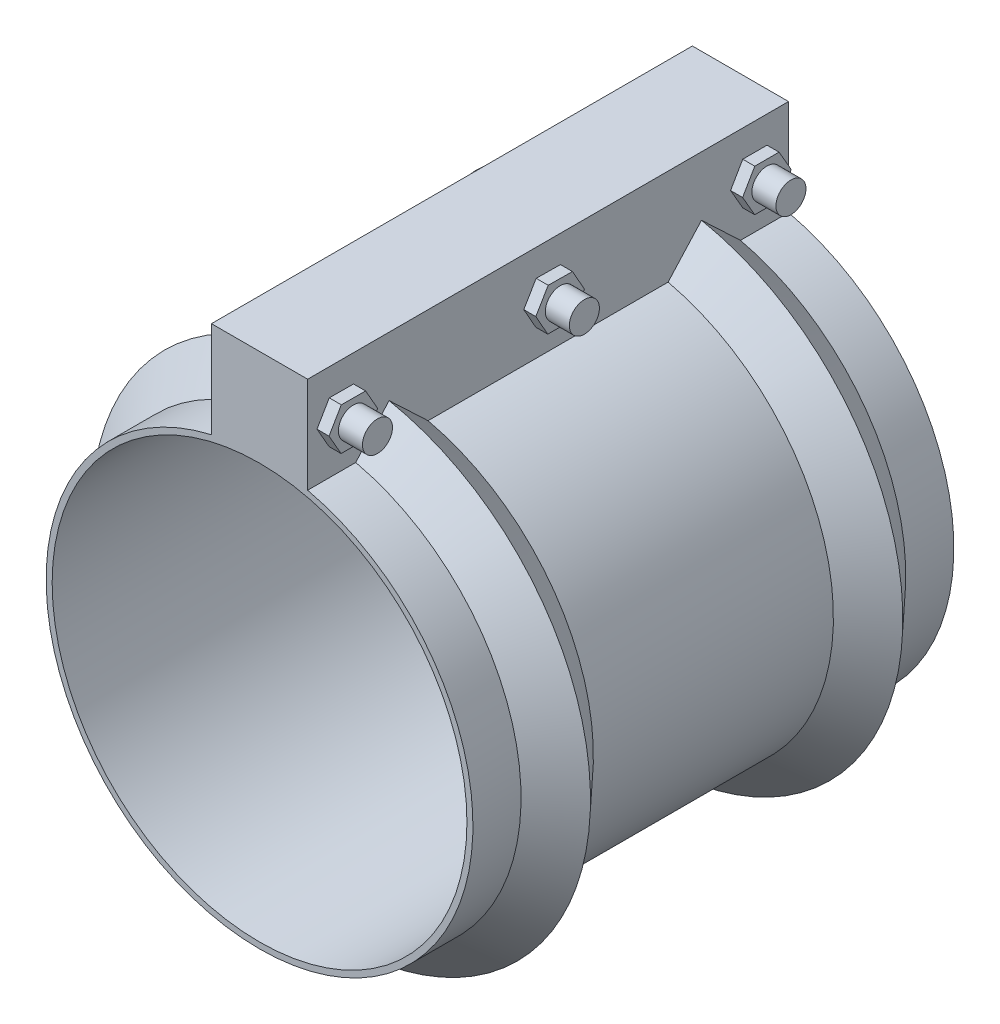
ISO-10303-21;
HEADER;
FILE_DESCRIPTION(('STEP AP214'),'2;1');
FILE_NAME('part.step','',(''),(''),'','','');
FILE_SCHEMA(('AUTOMOTIVE_DESIGN { 1 0 10303 214 1 1 1 1 }'));
ENDSEC;
DATA;
#1=APPLICATION_CONTEXT('core data for automotive mechanical design processes');
#2=APPLICATION_PROTOCOL_DEFINITION('international standard','automotive_design',2000,#1);
#3=PRODUCT_CONTEXT('',#1,'mechanical');
#4=PRODUCT('Part','Part','',(#3));
#5=PRODUCT_RELATED_PRODUCT_CATEGORY('part','',(#4));
#6=PRODUCT_DEFINITION_FORMATION('','',#4);
#7=PRODUCT_DEFINITION_CONTEXT('part definition',#1,'design');
#8=PRODUCT_DEFINITION('design','',#6,#7);
#9=PRODUCT_DEFINITION_SHAPE('','',#8);
#10=(LENGTH_UNIT() NAMED_UNIT(*) SI_UNIT(.MILLI.,.METRE.));
#11=(NAMED_UNIT(*) PLANE_ANGLE_UNIT() SI_UNIT($,.RADIAN.));
#12=(NAMED_UNIT(*) SI_UNIT($,.STERADIAN.) SOLID_ANGLE_UNIT());
#13=UNCERTAINTY_MEASURE_WITH_UNIT(LENGTH_MEASURE(1.E-05),#10,'distance_accuracy_value','');
#14=(GEOMETRIC_REPRESENTATION_CONTEXT(3) GLOBAL_UNCERTAINTY_ASSIGNED_CONTEXT((#13)) GLOBAL_UNIT_ASSIGNED_CONTEXT((#10,
#11,#12)) REPRESENTATION_CONTEXT('',''));
#15=CARTESIAN_POINT('',(0.,0.,0.));
#16=DIRECTION('',(0.,0.,1.));
#17=DIRECTION('',(1.,0.,0.));
#18=AXIS2_PLACEMENT_3D('',#15,#16,#17);
#19=CARTESIAN_POINT('',(25.4,160.61323989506,-127.));
#20=DIRECTION('',(1.,0.,0.));
#21=DIRECTION('',(0.,1.,0.));
#22=AXIS2_PLACEMENT_3D('',#19,#20,#21);
#23=PLANE('',#22);
#24=CARTESIAN_POINT('',(25.4,158.955837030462,56.9458853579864));
#25=CARTESIAN_POINT('',(25.4,155.700993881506,59.919761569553));
#26=CARTESIAN_POINT('',(25.4,152.44506422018,62.8924498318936));
#27=CARTESIAN_POINT('',(25.4,145.930464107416,68.8348211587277));
#28=CARTESIAN_POINT('',(25.4,142.671793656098,71.8045042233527));
#29=CARTESIAN_POINT('',(25.4,136.151194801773,77.7401897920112));
#30=CARTESIAN_POINT('',(25.4,132.889266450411,80.706192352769));
#31=CARTESIAN_POINT('',(25.4,126.361308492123,86.6336858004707));
#32=CARTESIAN_POINT('',(25.4,123.09527888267,89.5951766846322));
#33=CARTESIAN_POINT('',(25.4,116.558024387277,95.5125134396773));
#34=CARTESIAN_POINT('',(25.4,113.28679942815,98.4683592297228));
#35=CARTESIAN_POINT('',(25.4,106.737773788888,104.372749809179));
#36=CARTESIAN_POINT('',(25.4,103.459973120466,107.321294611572));
#37=CARTESIAN_POINT('',(25.4,98.53677095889,111.736916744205));
#38=CARTESIAN_POINT('',(25.4,96.8946066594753,113.207603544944));
#39=CARTESIAN_POINT('',(25.4,93.6077723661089,116.14617346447));
#40=CARTESIAN_POINT('',(25.4,91.963102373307,117.614056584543));
#41=CARTESIAN_POINT('',(25.4,88.6708477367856,120.546571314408));
#42=CARTESIAN_POINT('',(25.4,87.023263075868,122.011202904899));
#43=CARTESIAN_POINT('',(25.4,83.7246589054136,124.936597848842));
#44=CARTESIAN_POINT('',(25.4,82.0736393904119,126.39736119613));
#45=CARTESIAN_POINT('',(25.4,80.4206401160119,127.855884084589));
#46=B_SPLINE_CURVE_WITH_KNOTS('',3,(#24,#25,#26,#27,#28,#29,#30,#31,#32,#33,#34,#35,#36,#37,#38,
#39,#40,#41,#42,#43,#44,#45),.UNSPECIFIED.,.F.,.F.,(4,2,2,2,2,2,2,2,2,2,4),(0.,13.2265459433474,
26.4530913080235,39.6794302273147,52.9057773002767,66.1323123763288,79.3588239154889,
85.9721872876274,92.5855476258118,99.1989471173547,105.812357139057),.UNSPECIFIED.);
#47=CARTESIAN_POINT('',(25.4,129.291130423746,83.9733444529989));
#48=VERTEX_POINT('',#47);
#49=CARTESIAN_POINT('',(25.4,109.81323989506,101.6));
#50=VERTEX_POINT('',#49);
#51=EDGE_CURVE('E402',#48,#50,#46,.T.);
#52=ORIENTED_EDGE('',*,*,#51,.F.);
#53=CARTESIAN_POINT('',(25.4,74.3594535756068,26.4941256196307));
#54=CARTESIAN_POINT('',(25.4,75.9593023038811,28.1304046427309));
#55=CARTESIAN_POINT('',(25.4,77.5564577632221,29.7693122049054));
#56=CARTESIAN_POINT('',(25.4,80.7461205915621,33.051637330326));
#57=CARTESIAN_POINT('',(25.4,82.338627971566,34.6950548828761));
#58=CARTESIAN_POINT('',(25.4,85.5197270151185,37.9856465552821));
#59=CARTESIAN_POINT('',(25.4,87.1083187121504,39.6328206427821));
#60=CARTESIAN_POINT('',(25.4,90.2821550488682,42.9303917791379));
#61=CARTESIAN_POINT('',(25.4,91.8673996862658,44.5807888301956));
#62=CARTESIAN_POINT('',(25.4,96.6187620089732,49.5360290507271));
#63=CARTESIAN_POINT('',(25.4,99.780579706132,52.8449954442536));
#64=CARTESIAN_POINT('',(25.4,106.095560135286,59.4711870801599));
#65=CARTESIAN_POINT('',(25.4,109.248722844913,62.788412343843));
#66=CARTESIAN_POINT('',(25.4,115.548255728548,69.429178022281));
#67=CARTESIAN_POINT('',(25.4,118.694626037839,72.7527183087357));
#68=CARTESIAN_POINT('',(25.4,124.982039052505,79.4048273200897));
#69=CARTESIAN_POINT('',(25.4,128.123081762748,82.7333960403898));
#70=CARTESIAN_POINT('',(25.4,134.400959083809,89.3946336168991));
#71=CARTESIAN_POINT('',(25.4,137.537793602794,92.7273025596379));
#72=CARTESIAN_POINT('',(25.4,143.807935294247,99.3959581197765));
#73=CARTESIAN_POINT('',(25.4,146.941242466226,102.731944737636));
#74=CARTESIAN_POINT('',(25.4,150.073159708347,106.069234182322));
#75=B_SPLINE_CURVE_WITH_KNOTS('',3,(#53,#54,#55,#56,#57,#58,#59,#60,#61,#62,#63,#64,#65,#66,#67,
#68,#69,#70,#71,#72,#73,#74),.UNSPECIFIED.,.F.,.F.,(4,2,2,2,2,2,2,2,2,2,4),(0.,6.86529056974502,
13.7305648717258,20.5957802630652,27.4610003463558,41.1911312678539,54.9212976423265,
68.6511879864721,82.3810657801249,96.1112384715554,109.841413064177),.UNSPECIFIED.);
#76=CARTESIAN_POINT('',(25.4,109.81323989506,63.3850655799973));
#77=VERTEX_POINT('',#76);
#78=EDGE_CURVE('E397',#77,#48,#75,.T.);
#79=ORIENTED_EDGE('',*,*,#78,.F.);
#80=DIRECTION('',(0.,0.,1.));
#81=VECTOR('',#80,1.);
#82=CARTESIAN_POINT('',(25.4,109.81323989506,-127.));
#83=LINE('',#82,#81);
#84=CARTESIAN_POINT('',(25.4,109.81323989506,-63.3850655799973));
#85=VERTEX_POINT('',#84);
#86=EDGE_CURVE('E361',#85,#77,#83,.T.);
#87=ORIENTED_EDGE('',*,*,#86,.F.);
#88=CARTESIAN_POINT('',(25.4,158.955837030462,-108.039180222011));
#89=CARTESIAN_POINT('',(25.4,155.700993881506,-105.065304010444));
#90=CARTESIAN_POINT('',(25.4,152.44506422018,-102.092615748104));
#91=CARTESIAN_POINT('',(25.4,145.930464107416,-96.1502444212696));
#92=CARTESIAN_POINT('',(25.4,142.671793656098,-93.1805613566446));
#93=CARTESIAN_POINT('',(25.4,136.151194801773,-87.244875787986));
#94=CARTESIAN_POINT('',(25.4,132.889266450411,-84.2788732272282));
#95=CARTESIAN_POINT('',(25.4,126.361308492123,-78.3513797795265));
#96=CARTESIAN_POINT('',(25.4,123.09527888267,-75.3898888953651));
#97=CARTESIAN_POINT('',(25.4,116.558024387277,-69.4725521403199));
#98=CARTESIAN_POINT('',(25.4,113.28679942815,-66.5167063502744));
#99=CARTESIAN_POINT('',(25.4,106.737773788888,-60.6123157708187));
#100=CARTESIAN_POINT('',(25.4,103.459973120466,-57.6637709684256));
#101=CARTESIAN_POINT('',(25.4,98.53677095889,-53.2481488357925));
#102=CARTESIAN_POINT('',(25.4,96.8946066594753,-51.7774620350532));
#103=CARTESIAN_POINT('',(25.4,93.6077723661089,-48.8388921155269));
#104=CARTESIAN_POINT('',(25.4,91.963102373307,-47.3710089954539));
#105=CARTESIAN_POINT('',(25.4,88.6708477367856,-44.4384942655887));
#106=CARTESIAN_POINT('',(25.4,87.023263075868,-42.973862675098));
#107=CARTESIAN_POINT('',(25.4,83.7246589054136,-40.0484677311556));
#108=CARTESIAN_POINT('',(25.4,82.0736393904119,-38.5877043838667));
#109=CARTESIAN_POINT('',(25.4,80.4206401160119,-37.129181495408));
#110=B_SPLINE_CURVE_WITH_KNOTS('',3,(#88,#89,#90,#91,#92,#93,#94,#95,#96,#97,#98,#99,#100,#101,
#102,#103,#104,#105,#106,#107,#108,#109),.UNSPECIFIED.,.F.,.F.,(4,2,2,2,2,2,2,2,2,2,4),(0.,
13.2265459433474,26.4530913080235,39.6794302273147,52.9057773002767,66.1323123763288,
79.3588239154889,85.9721872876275,92.5855476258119,99.1989471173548,105.812357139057),.UNSPECIFIED.);
#111=CARTESIAN_POINT('',(25.4,129.291130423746,-81.0117211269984));
#112=VERTEX_POINT('',#111);
#113=EDGE_CURVE('E373',#112,#85,#110,.T.);
#114=ORIENTED_EDGE('',*,*,#113,.F.);
#115=CARTESIAN_POINT('',(25.4,74.3594535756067,-138.490939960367));
#116=CARTESIAN_POINT('',(25.4,75.9593023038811,-136.854660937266));
#117=CARTESIAN_POINT('',(25.4,77.5564577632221,-135.215753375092));
#118=CARTESIAN_POINT('',(25.4,80.7461205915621,-131.933428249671));
#119=CARTESIAN_POINT('',(25.4,82.338627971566,-130.290010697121));
#120=CARTESIAN_POINT('',(25.4,85.5197270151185,-126.999419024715));
#121=CARTESIAN_POINT('',(25.4,87.1083187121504,-125.352244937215));
#122=CARTESIAN_POINT('',(25.4,90.2821550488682,-122.054673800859));
#123=CARTESIAN_POINT('',(25.4,91.8673996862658,-120.404276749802));
#124=CARTESIAN_POINT('',(25.4,96.6187620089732,-115.44903652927));
#125=CARTESIAN_POINT('',(25.4,99.780579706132,-112.140070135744));
#126=CARTESIAN_POINT('',(25.4,106.095560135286,-105.513878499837));
#127=CARTESIAN_POINT('',(25.4,109.248722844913,-102.196653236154));
#128=CARTESIAN_POINT('',(25.4,115.548255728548,-95.5558875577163));
#129=CARTESIAN_POINT('',(25.4,118.694626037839,-92.2323472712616));
#130=CARTESIAN_POINT('',(25.4,124.982039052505,-85.5802382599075));
#131=CARTESIAN_POINT('',(25.4,128.123081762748,-82.2516695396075));
#132=CARTESIAN_POINT('',(25.4,134.400959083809,-75.5904319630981));
#133=CARTESIAN_POINT('',(25.4,137.537793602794,-72.2577630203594));
#134=CARTESIAN_POINT('',(25.4,143.807935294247,-65.5891074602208));
#135=CARTESIAN_POINT('',(25.4,146.941242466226,-62.2531208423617));
#136=CARTESIAN_POINT('',(25.4,150.073159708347,-58.9158313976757));
#137=B_SPLINE_CURVE_WITH_KNOTS('',3,(#115,#116,#117,#118,#119,#120,#121,#122,#123,#124,#125,
#126,#127,#128,#129,#130,#131,#132,#133,#134,#135,#136),.UNSPECIFIED.,.F.,.F.,(4,2,2,2,2,2,2,2,
2,2,4),(0.,6.86529056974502,13.7305648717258,20.5957802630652,27.4610003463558,41.1911312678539,
54.9212976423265,68.6511879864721,82.3810657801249,96.1112384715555,109.841413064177),.UNSPECIFIED.);
#138=CARTESIAN_POINT('',(25.4,109.81323989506,-101.6));
#139=VERTEX_POINT('',#138);
#140=EDGE_CURVE('E356',#139,#112,#137,.T.);
#141=ORIENTED_EDGE('',*,*,#140,.F.);
#142=CARTESIAN_POINT('',(25.4,109.81323989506,-127.));
#143=VERTEX_POINT('',#142);
#144=EDGE_CURVE('E359',#143,#139,#83,.T.);
#145=ORIENTED_EDGE('',*,*,#144,.F.);
#146=DIRECTION('',(0.,1.,0.));
#147=VECTOR('',#146,1.);
#148=CARTESIAN_POINT('',(25.4,160.61323989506,-127.));
#149=LINE('',#148,#147);
#150=CARTESIAN_POINT('',(25.4,160.61323989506,-127.));
#151=VERTEX_POINT('',#150);
#152=EDGE_CURVE('E347',#143,#151,#149,.T.);
#153=ORIENTED_EDGE('',*,*,#152,.T.);
#154=DIRECTION('',(0.,0.,1.));
#155=VECTOR('',#154,1.);
#156=CARTESIAN_POINT('',(25.4,160.61323989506,-127.));
#157=LINE('',#156,#155);
#158=CARTESIAN_POINT('',(25.4,160.61323989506,127.));
#159=VERTEX_POINT('',#158);
#160=EDGE_CURVE('E357',#151,#159,#157,.T.);
#161=ORIENTED_EDGE('',*,*,#160,.T.);
#162=DIRECTION('',(0.,1.,0.));
#163=VECTOR('',#162,1.);
#164=CARTESIAN_POINT('',(25.4,160.61323989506,127.));
#165=LINE('',#164,#163);
#166=CARTESIAN_POINT('',(25.4,109.81323989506,127.));
#167=VERTEX_POINT('',#166);
#168=EDGE_CURVE('E338',#167,#159,#165,.T.);
#169=ORIENTED_EDGE('',*,*,#168,.F.);
#170=EDGE_CURVE('E362',#50,#167,#83,.T.);
#171=ORIENTED_EDGE('',*,*,#170,.F.);
#172=EDGE_LOOP('',(#52,#79,#87,#114,#141,#145,#153,#161,#169,#171));
#173=FACE_BOUND('',#172,.T.);
#174=DIRECTION('',(0.,0.868599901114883,0.495514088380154));
#175=VECTOR('',#174,1.);
#176=CARTESIAN_POINT('',(25.4,135.146872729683,96.3885618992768));
#177=LINE('',#176,#175);
#178=CARTESIAN_POINT('',(25.4,135.146872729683,96.3885618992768));
#179=VERTEX_POINT('',#178);
#180=CARTESIAN_POINT('',(25.4,146.292407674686,102.746805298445));
#181=VERTEX_POINT('',#180);
#182=EDGE_CURVE('E310',#179,#181,#177,.T.);
#183=ORIENTED_EDGE('',*,*,#182,.F.);
#184=DIRECTION('',(0.,0.863427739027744,-0.504472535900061));
#185=VECTOR('',#184,1.);
#186=CARTESIAN_POINT('',(25.4,124.067704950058,102.861756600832));
#187=LINE('',#186,#185);
#188=CARTESIAN_POINT('',(25.4,124.067704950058,102.861756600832));
#189=VERTEX_POINT('',#188);
#190=EDGE_CURVE('E292',#189,#179,#187,.T.);
#191=ORIENTED_EDGE('',*,*,#190,.F.);
#192=DIRECTION('',(0.,-0.00517216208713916,-0.999986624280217));
#193=VECTOR('',#192,1.);
#194=CARTESIAN_POINT('',(25.4,124.134072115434,115.693194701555));
#195=LINE('',#194,#193);
#196=CARTESIAN_POINT('',(25.4,124.134072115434,115.693194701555));
#197=VERTEX_POINT('',#196);
#198=EDGE_CURVE('E297',#197,#189,#195,.T.);
#199=ORIENTED_EDGE('',*,*,#198,.F.);
#200=DIRECTION('',(0.,-0.868599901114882,-0.495514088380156));
#201=VECTOR('',#200,1.);
#202=CARTESIAN_POINT('',(25.4,135.279607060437,122.051438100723));
#203=LINE('',#202,#201);
#204=CARTESIAN_POINT('',(25.4,135.279607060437,122.051438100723));
#205=VERTEX_POINT('',#204);
#206=EDGE_CURVE('E316',#205,#197,#203,.T.);
#207=ORIENTED_EDGE('',*,*,#206,.F.);
#208=DIRECTION('',(0.,-0.863427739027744,0.504472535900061));
#209=VECTOR('',#208,1.);
#210=CARTESIAN_POINT('',(25.4,146.358774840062,115.578243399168));
#211=LINE('',#210,#209);
#212=CARTESIAN_POINT('',(25.4,146.358774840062,115.578243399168));
#213=VERTEX_POINT('',#212);
#214=EDGE_CURVE('E314',#213,#205,#211,.T.);
#215=ORIENTED_EDGE('',*,*,#214,.F.);
#216=DIRECTION('',(0.,0.00517216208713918,0.999986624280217));
#217=VECTOR('',#216,1.);
#218=CARTESIAN_POINT('',(25.4,146.292407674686,102.746805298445));
#219=LINE('',#218,#217);
#220=EDGE_CURVE('E312',#181,#213,#219,.T.);
#221=ORIENTED_EDGE('',*,*,#220,.F.);
#222=EDGE_LOOP('',(#183,#191,#199,#207,#215,#221));
#223=FACE_BOUND('',#222,.T.);
#224=DIRECTION('',(0.,0.871288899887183,0.490770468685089));
#225=VECTOR('',#224,1.);
#226=CARTESIAN_POINT('',(25.4,135.076907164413,-12.8308854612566));
#227=LINE('',#226,#225);
#228=CARTESIAN_POINT('',(25.4,135.076907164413,-12.8308854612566));
#229=VERTEX_POINT('',#228);
#230=CARTESIAN_POINT('',(25.4,146.256946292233,-6.53351033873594));
#231=VERTEX_POINT('',#230);
#232=EDGE_CURVE('E249',#229,#231,#227,.T.);
#233=ORIENTED_EDGE('',*,*,#232,.F.);
#234=DIRECTION('',(0.,0.860664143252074,-0.509173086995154));
#235=VECTOR('',#234,1.);
#236=CARTESIAN_POINT('',(25.4,124.03320076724,-6.29737512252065));
#237=LINE('',#236,#235);
#238=CARTESIAN_POINT('',(25.4,124.03320076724,-6.29737512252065));
#239=VERTEX_POINT('',#238);
#240=EDGE_CURVE('E246',#239,#229,#237,.T.);
#241=ORIENTED_EDGE('',*,*,#240,.F.);
#242=DIRECTION('',(0.,-0.0106247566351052,-0.999943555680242));
#243=VECTOR('',#242,1.);
#244=CARTESIAN_POINT('',(25.4,124.169533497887,6.53351033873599));
#245=LINE('',#244,#243);
#246=CARTESIAN_POINT('',(25.4,124.169533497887,6.53351033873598));
#247=VERTEX_POINT('',#246);
#248=EDGE_CURVE('E259',#247,#239,#245,.T.);
#249=ORIENTED_EDGE('',*,*,#248,.F.);
#250=DIRECTION('',(0.,-0.871288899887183,-0.490770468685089));
#251=VECTOR('',#250,1.);
#252=CARTESIAN_POINT('',(25.4,135.349572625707,12.8308854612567));
#253=LINE('',#252,#251);
#254=CARTESIAN_POINT('',(25.4,135.349572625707,12.8308854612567));
#255=VERTEX_POINT('',#254);
#256=EDGE_CURVE('E275',#255,#247,#253,.T.);
#257=ORIENTED_EDGE('',*,*,#256,.F.);
#258=DIRECTION('',(0.,-0.860664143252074,0.509173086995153));
#259=VECTOR('',#258,1.);
#260=CARTESIAN_POINT('',(25.4,146.39327902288,6.29737512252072));
#261=LINE('',#260,#259);
#262=CARTESIAN_POINT('',(25.4,146.39327902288,6.29737512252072));
#263=VERTEX_POINT('',#262);
#264=EDGE_CURVE('E273',#263,#255,#261,.T.);
#265=ORIENTED_EDGE('',*,*,#264,.F.);
#266=DIRECTION('',(0.,0.0106247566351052,0.999943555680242));
#267=VECTOR('',#266,1.);
#268=CARTESIAN_POINT('',(25.4,146.256946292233,-6.53351033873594));
#269=LINE('',#268,#267);
#270=EDGE_CURVE('E271',#231,#263,#269,.T.);
#271=ORIENTED_EDGE('',*,*,#270,.F.);
#272=EDGE_LOOP('',(#233,#241,#249,#257,#265,#271));
#273=FACE_BOUND('',#272,.T.);
#274=DIRECTION('',(0.,0.866025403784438,0.500000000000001));
#275=VECTOR('',#274,1.);
#276=CARTESIAN_POINT('',(25.4,135.21323989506,-122.051609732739));
#277=LINE('',#276,#275);
#278=CARTESIAN_POINT('',(25.4,135.21323989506,-122.051609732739));
#279=VERTEX_POINT('',#278);
#280=CARTESIAN_POINT('',(25.4,146.32573989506,-115.63580486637));
#281=VERTEX_POINT('',#280);
#282=EDGE_CURVE('E531',#279,#281,#277,.T.);
#283=ORIENTED_EDGE('',*,*,#282,.F.);
#284=DIRECTION('',(0.,0.866025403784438,-0.5));
#285=VECTOR('',#284,1.);
#286=CARTESIAN_POINT('',(25.4,124.10073989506,-115.63580486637));
#287=LINE('',#286,#285);
#288=CARTESIAN_POINT('',(25.4,124.10073989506,-115.63580486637));
#289=VERTEX_POINT('',#288);
#290=EDGE_CURVE('E244',#289,#279,#287,.T.);
#291=ORIENTED_EDGE('',*,*,#290,.F.);
#292=DIRECTION('',(0.,0.,-1.));
#293=VECTOR('',#292,1.);
#294=CARTESIAN_POINT('',(25.4,124.10073989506,-102.80419513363));
#295=LINE('',#294,#293);
#296=CARTESIAN_POINT('',(25.4,124.10073989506,-102.80419513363));
#297=VERTEX_POINT('',#296);
#298=EDGE_CURVE('E240',#297,#289,#295,.T.);
#299=ORIENTED_EDGE('',*,*,#298,.F.);
#300=DIRECTION('',(0.,-0.866025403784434,-0.500000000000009));
#301=VECTOR('',#300,1.);
#302=CARTESIAN_POINT('',(25.4,135.21323989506,-96.3883902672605));
#303=LINE('',#302,#301);
#304=CARTESIAN_POINT('',(25.4,135.21323989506,-96.3883902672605));
#305=VERTEX_POINT('',#304);
#306=EDGE_CURVE('E537',#305,#297,#303,.T.);
#307=ORIENTED_EDGE('',*,*,#306,.F.);
#308=DIRECTION('',(0.,-0.866025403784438,0.500000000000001));
#309=VECTOR('',#308,1.);
#310=CARTESIAN_POINT('',(25.4,146.32573989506,-102.80419513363));
#311=LINE('',#310,#309);
#312=CARTESIAN_POINT('',(25.4,146.32573989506,-102.80419513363));
#313=VERTEX_POINT('',#312);
#314=EDGE_CURVE('E535',#313,#305,#311,.T.);
#315=ORIENTED_EDGE('',*,*,#314,.F.);
#316=DIRECTION('',(0.,0.,1.));
#317=VECTOR('',#316,1.);
#318=CARTESIAN_POINT('',(25.4,146.32573989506,-115.63580486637));
#319=LINE('',#318,#317);
#320=EDGE_CURVE('E533',#281,#313,#319,.T.);
#321=ORIENTED_EDGE('',*,*,#320,.F.);
#322=EDGE_LOOP('',(#283,#291,#299,#307,#315,#321));
#323=FACE_BOUND('',#322,.T.);
#324=ADVANCED_FACE('F35',(#173,#223,#273,#323),#23,.T.);
#325=CARTESIAN_POINT('',(0.,109.5375,127.));
#326=DIRECTION('',(0.,0.,-1.));
#327=DIRECTION('',(-1.,0.,0.));
#328=AXIS2_PLACEMENT_3D('',#325,#326,#327);
#329=PLANE('',#328);
#330=CARTESIAN_POINT('',(0.,0.,127.));
#331=DIRECTION('',(0.,0.,1.));
#332=DIRECTION('',(1.,0.,0.));
#333=AXIS2_PLACEMENT_3D('',#330,#331,#332);
#334=CIRCLE('',#333,109.5375);
#335=CARTESIAN_POINT('',(109.5375,0.,127.));
#336=VERTEX_POINT('',#335);
#337=EDGE_CURVE('E434',#336,#336,#334,.T.);
#338=ORIENTED_EDGE('',*,*,#337,.F.);
#339=EDGE_LOOP('',(#338));
#340=FACE_BOUND('',#339,.T.);
#341=CARTESIAN_POINT('',(0.,0.,127.));
#342=DIRECTION('',(0.,0.,1.));
#343=DIRECTION('',(1.,0.,0.));
#344=AXIS2_PLACEMENT_3D('',#341,#342,#343);
#345=CIRCLE('',#344,112.7125);
#346=CARTESIAN_POINT('',(-25.4,109.81323989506,127.));
#347=VERTEX_POINT('',#346);
#348=EDGE_CURVE('E460',#347,#167,#345,.T.);
#349=ORIENTED_EDGE('',*,*,#348,.T.);
#350=ORIENTED_EDGE('',*,*,#168,.T.);
#351=DIRECTION('',(-1.,0.,0.));
#352=VECTOR('',#351,1.);
#353=CARTESIAN_POINT('',(-25.4,160.61323989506,127.));
#354=LINE('',#353,#352);
#355=CARTESIAN_POINT('',(-25.4,160.61323989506,127.));
#356=VERTEX_POINT('',#355);
#357=EDGE_CURVE('E341',#159,#356,#354,.T.);
#358=ORIENTED_EDGE('',*,*,#357,.T.);
#359=DIRECTION('',(0.,-1.,0.));
#360=VECTOR('',#359,1.);
#361=CARTESIAN_POINT('',(-25.4,160.61323989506,127.));
#362=LINE('',#361,#360);
#363=EDGE_CURVE('E335',#356,#347,#362,.T.);
#364=ORIENTED_EDGE('',*,*,#363,.T.);
#365=EDGE_LOOP('',(#349,#350,#358,#364));
#366=FACE_BOUND('',#365,.T.);
#367=ADVANCED_FACE('F386',(#340,#366),#329,.F.);
#368=CARTESIAN_POINT('',(0.,0.,248.174311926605));
#369=DIRECTION('',(0.,0.,1.));
#370=DIRECTION('',(1.,0.,0.));
#371=AXIS2_PLACEMENT_3D('',#368,#369,#370);
#372=CYLINDRICAL_SURFACE('',#371,112.7125);
#373=ORIENTED_EDGE('',*,*,#348,.F.);
#374=DIRECTION('',(0.,0.,1.));
#375=VECTOR('',#374,1.);
#376=CARTESIAN_POINT('',(-25.4,109.81323989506,-127.));
#377=LINE('',#376,#375);
#378=CARTESIAN_POINT('',(-25.4,109.81323989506,101.6));
#379=VERTEX_POINT('',#378);
#380=EDGE_CURVE('E353',#379,#347,#377,.T.);
#381=ORIENTED_EDGE('',*,*,#380,.F.);
#382=CARTESIAN_POINT('',(0.,0.,101.6));
#383=DIRECTION('',(0.,0.,1.));
#384=DIRECTION('',(1.,0.,0.));
#385=AXIS2_PLACEMENT_3D('',#382,#383,#384);
#386=CIRCLE('',#385,112.7125);
#387=EDGE_CURVE('E457',#379,#50,#386,.T.);
#388=ORIENTED_EDGE('',*,*,#387,.T.);
#389=ORIENTED_EDGE('',*,*,#170,.T.);
#390=EDGE_LOOP('',(#373,#381,#388,#389));
#391=FACE_BOUND('',#390,.T.);
#392=ADVANCED_FACE('F698',(#391),#372,.T.);
#393=CARTESIAN_POINT('',(0.,0.,83.9733444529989));
#394=DIRECTION('',(0.,0.,-1.));
#395=DIRECTION('',(-1.,0.,0.));
#396=AXIS2_PLACEMENT_3D('',#393,#394,#395);
#397=CONICAL_SURFACE('',#396,131.7625,0.824186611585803);
#398=ORIENTED_EDGE('',*,*,#387,.F.);
#399=CARTESIAN_POINT('',(-25.4,80.4206401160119,127.855884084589));
#400=CARTESIAN_POINT('',(-25.4,82.0736393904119,126.39736119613));
#401=CARTESIAN_POINT('',(-25.4,83.7246589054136,124.936597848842));
#402=CARTESIAN_POINT('',(-25.4,87.023263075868,122.011202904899));
#403=CARTESIAN_POINT('',(-25.4,88.6708477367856,120.546571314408));
#404=CARTESIAN_POINT('',(-25.4,91.963102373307,117.614056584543));
#405=CARTESIAN_POINT('',(-25.4,93.6077723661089,116.14617346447));
#406=CARTESIAN_POINT('',(-25.4,96.8946066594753,113.207603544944));
#407=CARTESIAN_POINT('',(-25.4,98.53677095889,111.736916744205));
#408=CARTESIAN_POINT('',(-25.4,103.459973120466,107.321294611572));
#409=CARTESIAN_POINT('',(-25.4,106.737773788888,104.372749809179));
#410=CARTESIAN_POINT('',(-25.4,113.28679942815,98.4683592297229));
#411=CARTESIAN_POINT('',(-25.4,116.558024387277,95.5125134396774));
#412=CARTESIAN_POINT('',(-25.4,123.09527888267,89.5951766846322));
#413=CARTESIAN_POINT('',(-25.4,126.361308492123,86.6336858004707));
#414=CARTESIAN_POINT('',(-25.4,132.889266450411,80.706192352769));
#415=CARTESIAN_POINT('',(-25.4,136.151194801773,77.7401897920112));
#416=CARTESIAN_POINT('',(-25.4,142.671793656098,71.8045042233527));
#417=CARTESIAN_POINT('',(-25.4,145.930464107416,68.8348211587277));
#418=CARTESIAN_POINT('',(-25.4,152.44506422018,62.8924498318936));
#419=CARTESIAN_POINT('',(-25.4,155.700993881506,59.919761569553));
#420=CARTESIAN_POINT('',(-25.4,158.955837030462,56.9458853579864));
#421=B_SPLINE_CURVE_WITH_KNOTS('',3,(#399,#400,#401,#402,#403,#404,#405,#406,#407,#408,#409,
#410,#411,#412,#413,#414,#415,#416,#417,#418,#419,#420),.UNSPECIFIED.,.F.,.F.,(4,2,2,2,2,2,2,2,
2,2,4),(0.,6.61341002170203,13.2268095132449,19.8401698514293,26.4535332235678,39.680044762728,
52.9065798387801,66.132926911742,79.3592658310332,92.5858111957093,105.812357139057),.UNSPECIFIED.);
#422=CARTESIAN_POINT('',(-25.4,129.291130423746,83.9733444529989));
#423=VERTEX_POINT('',#422);
#424=EDGE_CURVE('E425',#379,#423,#421,.T.);
#425=ORIENTED_EDGE('',*,*,#424,.T.);
#426=CARTESIAN_POINT('',(0.,0.,83.9733444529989));
#427=DIRECTION('',(0.,0.,1.));
#428=DIRECTION('',(1.,0.,0.));
#429=AXIS2_PLACEMENT_3D('',#426,#427,#428);
#430=CIRCLE('',#429,131.7625);
#431=EDGE_CURVE('E454',#423,#48,#430,.T.);
#432=ORIENTED_EDGE('',*,*,#431,.T.);
#433=ORIENTED_EDGE('',*,*,#51,.T.);
#434=EDGE_LOOP('',(#398,#425,#432,#433));
#435=FACE_BOUND('',#434,.T.);
#436=ADVANCED_FACE('F413',(#435),#397,.T.);
#437=CARTESIAN_POINT('',(0.,0.,63.3850655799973));
#438=DIRECTION('',(0.,0.,1.));
#439=DIRECTION('',(1.,0.,0.));
#440=AXIS2_PLACEMENT_3D('',#437,#438,#439);
#441=CONICAL_SURFACE('',#440,112.7125,0.746609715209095);
#442=ORIENTED_EDGE('',*,*,#431,.F.);
#443=CARTESIAN_POINT('',(-25.4,150.073159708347,106.069234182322));
#444=CARTESIAN_POINT('',(-25.4,146.941242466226,102.731944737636));
#445=CARTESIAN_POINT('',(-25.4,143.807935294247,99.3959581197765));
#446=CARTESIAN_POINT('',(-25.4,137.537793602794,92.7273025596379));
#447=CARTESIAN_POINT('',(-25.4,134.400959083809,89.3946336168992));
#448=CARTESIAN_POINT('',(-25.4,128.123081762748,82.7333960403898));
#449=CARTESIAN_POINT('',(-25.4,124.982039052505,79.4048273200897));
#450=CARTESIAN_POINT('',(-25.4,118.694626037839,72.7527183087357));
#451=CARTESIAN_POINT('',(-25.4,115.548255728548,69.429178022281));
#452=CARTESIAN_POINT('',(-25.4,109.248722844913,62.788412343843));
#453=CARTESIAN_POINT('',(-25.4,106.095560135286,59.4711870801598));
#454=CARTESIAN_POINT('',(-25.4,99.780579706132,52.8449954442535));
#455=CARTESIAN_POINT('',(-25.4,96.6187620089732,49.536029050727));
#456=CARTESIAN_POINT('',(-25.4,91.8673996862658,44.5807888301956));
#457=CARTESIAN_POINT('',(-25.4,90.2821550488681,42.9303917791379));
#458=CARTESIAN_POINT('',(-25.4,87.1083187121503,39.6328206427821));
#459=CARTESIAN_POINT('',(-25.4,85.5197270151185,37.9856465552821));
#460=CARTESIAN_POINT('',(-25.4,82.338627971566,34.6950548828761));
#461=CARTESIAN_POINT('',(-25.4,80.7461205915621,33.051637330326));
#462=CARTESIAN_POINT('',(-25.4,77.5564577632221,29.7693122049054));
#463=CARTESIAN_POINT('',(-25.4,75.9593023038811,28.1304046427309));
#464=CARTESIAN_POINT('',(-25.4,74.3594535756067,26.4941256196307));
#465=B_SPLINE_CURVE_WITH_KNOTS('',3,(#443,#444,#445,#446,#447,#448,#449,#450,#451,#452,#453,
#454,#455,#456,#457,#458,#459,#460,#461,#462,#463,#464),.UNSPECIFIED.,.F.,.F.,(4,2,2,2,2,2,2,2,
2,2,4),(0.,13.7301745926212,27.4603472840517,41.1902250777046,54.9201154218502,68.6502817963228,
82.3804127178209,89.2456328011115,96.1108481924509,102.976122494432,109.841413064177),.UNSPECIFIED.);
#466=CARTESIAN_POINT('',(-25.4,109.81323989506,63.3850655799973));
#467=VERTEX_POINT('',#466);
#468=EDGE_CURVE('E419',#423,#467,#465,.T.);
#469=ORIENTED_EDGE('',*,*,#468,.T.);
#470=CARTESIAN_POINT('',(0.,0.,63.3850655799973));
#471=DIRECTION('',(0.,0.,1.));
#472=DIRECTION('',(1.,0.,0.));
#473=AXIS2_PLACEMENT_3D('',#470,#471,#472);
#474=CIRCLE('',#473,112.7125);
#475=EDGE_CURVE('E451',#467,#77,#474,.T.);
#476=ORIENTED_EDGE('',*,*,#475,.T.);
#477=ORIENTED_EDGE('',*,*,#78,.T.);
#478=EDGE_LOOP('',(#442,#469,#476,#477));
#479=FACE_BOUND('',#478,.T.);
#480=ADVANCED_FACE('F408',(#479),#441,.T.);
#481=CARTESIAN_POINT('',(0.,0.,248.174311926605));
#482=DIRECTION('',(0.,0.,1.));
#483=DIRECTION('',(1.,0.,0.));
#484=AXIS2_PLACEMENT_3D('',#481,#482,#483);
#485=CYLINDRICAL_SURFACE('',#484,112.7125);
#486=ORIENTED_EDGE('',*,*,#475,.F.);
#487=CARTESIAN_POINT('',(-25.4,109.81323989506,-63.3850655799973));
#488=VERTEX_POINT('',#487);
#489=EDGE_CURVE('E366',#488,#467,#377,.T.);
#490=ORIENTED_EDGE('',*,*,#489,.F.);
#491=CARTESIAN_POINT('',(0.,0.,-63.3850655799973));
#492=DIRECTION('',(0.,0.,1.));
#493=DIRECTION('',(1.,0.,0.));
#494=AXIS2_PLACEMENT_3D('',#491,#492,#493);
#495=CIRCLE('',#494,112.7125);
#496=EDGE_CURVE('E448',#488,#85,#495,.T.);
#497=ORIENTED_EDGE('',*,*,#496,.T.);
#498=ORIENTED_EDGE('',*,*,#86,.T.);
#499=EDGE_LOOP('',(#486,#490,#497,#498));
#500=FACE_BOUND('',#499,.T.);
#501=ADVANCED_FACE('F412',(#500),#485,.T.);
#502=CARTESIAN_POINT('',(0.,0.,-81.0117211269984));
#503=DIRECTION('',(0.,0.,-1.));
#504=DIRECTION('',(-1.,0.,0.));
#505=AXIS2_PLACEMENT_3D('',#502,#503,#504);
#506=CONICAL_SURFACE('',#505,131.7625,0.824186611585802);
#507=ORIENTED_EDGE('',*,*,#496,.F.);
#508=CARTESIAN_POINT('',(-25.4,80.4206401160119,-37.129181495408));
#509=CARTESIAN_POINT('',(-25.4,82.0736393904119,-38.5877043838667));
#510=CARTESIAN_POINT('',(-25.4,83.7246589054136,-40.0484677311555));
#511=CARTESIAN_POINT('',(-25.4,87.023263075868,-42.973862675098));
#512=CARTESIAN_POINT('',(-25.4,88.6708477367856,-44.4384942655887));
#513=CARTESIAN_POINT('',(-25.4,91.963102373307,-47.3710089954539));
#514=CARTESIAN_POINT('',(-25.4,93.6077723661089,-48.8388921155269));
#515=CARTESIAN_POINT('',(-25.4,96.8946066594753,-51.7774620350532));
#516=CARTESIAN_POINT('',(-25.4,98.53677095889,-53.2481488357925));
#517=CARTESIAN_POINT('',(-25.4,103.459973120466,-57.6637709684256));
#518=CARTESIAN_POINT('',(-25.4,106.737773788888,-60.6123157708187));
#519=CARTESIAN_POINT('',(-25.4,113.28679942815,-66.5167063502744));
#520=CARTESIAN_POINT('',(-25.4,116.558024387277,-69.4725521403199));
#521=CARTESIAN_POINT('',(-25.4,123.09527888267,-75.3898888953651));
#522=CARTESIAN_POINT('',(-25.4,126.361308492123,-78.3513797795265));
#523=CARTESIAN_POINT('',(-25.4,132.889266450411,-84.2788732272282));
#524=CARTESIAN_POINT('',(-25.4,136.151194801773,-87.244875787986));
#525=CARTESIAN_POINT('',(-25.4,142.671793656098,-93.1805613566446));
#526=CARTESIAN_POINT('',(-25.4,145.930464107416,-96.1502444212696));
#527=CARTESIAN_POINT('',(-25.4,152.44506422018,-102.092615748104));
#528=CARTESIAN_POINT('',(-25.4,155.700993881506,-105.065304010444));
#529=CARTESIAN_POINT('',(-25.4,158.955837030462,-108.039180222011));
#530=B_SPLINE_CURVE_WITH_KNOTS('',3,(#508,#509,#510,#511,#512,#513,#514,#515,#516,#517,#518,
#519,#520,#521,#522,#523,#524,#525,#526,#527,#528,#529),.UNSPECIFIED.,.F.,.F.,(4,2,2,2,2,2,2,2,
2,2,4),(0.,6.61341002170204,13.2268095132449,19.8401698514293,26.4535332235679,39.680044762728,
52.9065798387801,66.1329269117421,79.3592658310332,92.5858111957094,105.812357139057),.UNSPECIFIED.);
#531=CARTESIAN_POINT('',(-25.4,129.291130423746,-81.0117211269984));
#532=VERTEX_POINT('',#531);
#533=EDGE_CURVE('E426',#488,#532,#530,.T.);
#534=ORIENTED_EDGE('',*,*,#533,.T.);
#535=CARTESIAN_POINT('',(0.,0.,-81.0117211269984));
#536=DIRECTION('',(0.,0.,1.));
#537=DIRECTION('',(1.,0.,0.));
#538=AXIS2_PLACEMENT_3D('',#535,#536,#537);
#539=CIRCLE('',#538,131.7625);
#540=EDGE_CURVE('E445',#532,#112,#539,.T.);
#541=ORIENTED_EDGE('',*,*,#540,.T.);
#542=ORIENTED_EDGE('',*,*,#113,.T.);
#543=EDGE_LOOP('',(#507,#534,#541,#542));
#544=FACE_BOUND('',#543,.T.);
#545=ADVANCED_FACE('F690',(#544),#506,.T.);
#546=CARTESIAN_POINT('',(0.,0.,-101.6));
#547=DIRECTION('',(0.,0.,1.));
#548=DIRECTION('',(1.,0.,0.));
#549=AXIS2_PLACEMENT_3D('',#546,#547,#548);
#550=CONICAL_SURFACE('',#549,112.7125,0.746609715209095);
#551=ORIENTED_EDGE('',*,*,#540,.F.);
#552=CARTESIAN_POINT('',(-25.4,150.073159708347,-58.9158313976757));
#553=CARTESIAN_POINT('',(-25.4,146.941242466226,-62.2531208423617));
#554=CARTESIAN_POINT('',(-25.4,143.807935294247,-65.5891074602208));
#555=CARTESIAN_POINT('',(-25.4,137.537793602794,-72.2577630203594));
#556=CARTESIAN_POINT('',(-25.4,134.400959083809,-75.5904319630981));
#557=CARTESIAN_POINT('',(-25.4,128.123081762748,-82.2516695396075));
#558=CARTESIAN_POINT('',(-25.4,124.982039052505,-85.5802382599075));
#559=CARTESIAN_POINT('',(-25.4,118.694626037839,-92.2323472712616));
#560=CARTESIAN_POINT('',(-25.4,115.548255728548,-95.5558875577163));
#561=CARTESIAN_POINT('',(-25.4,109.248722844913,-102.196653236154));
#562=CARTESIAN_POINT('',(-25.4,106.095560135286,-105.513878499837));
#563=CARTESIAN_POINT('',(-25.4,99.780579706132,-112.140070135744));
#564=CARTESIAN_POINT('',(-25.4,96.6187620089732,-115.44903652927));
#565=CARTESIAN_POINT('',(-25.4,91.8673996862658,-120.404276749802));
#566=CARTESIAN_POINT('',(-25.4,90.2821550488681,-122.054673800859));
#567=CARTESIAN_POINT('',(-25.4,87.1083187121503,-125.352244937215));
#568=CARTESIAN_POINT('',(-25.4,85.5197270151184,-126.999419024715));
#569=CARTESIAN_POINT('',(-25.4,82.338627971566,-130.290010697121));
#570=CARTESIAN_POINT('',(-25.4,80.746120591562,-131.933428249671));
#571=CARTESIAN_POINT('',(-25.4,77.5564577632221,-135.215753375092));
#572=CARTESIAN_POINT('',(-25.4,75.9593023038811,-136.854660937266));
#573=CARTESIAN_POINT('',(-25.4,74.3594535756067,-138.490939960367));
#574=B_SPLINE_CURVE_WITH_KNOTS('',3,(#552,#553,#554,#555,#556,#557,#558,#559,#560,#561,#562,
#563,#564,#565,#566,#567,#568,#569,#570,#571,#572,#573),.UNSPECIFIED.,.F.,.F.,(4,2,2,2,2,2,2,2,
2,2,4),(0.,13.7301745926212,27.4603472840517,41.1902250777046,54.9201154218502,68.6502817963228,
82.3804127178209,89.2456328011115,96.1108481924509,102.976122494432,109.841413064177),.UNSPECIFIED.);
#575=CARTESIAN_POINT('',(-25.4,109.81323989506,-101.6));
#576=VERTEX_POINT('',#575);
#577=EDGE_CURVE('E704',#532,#576,#574,.T.);
#578=ORIENTED_EDGE('',*,*,#577,.T.);
#579=CARTESIAN_POINT('',(0.,0.,-101.6));
#580=DIRECTION('',(0.,0.,1.));
#581=DIRECTION('',(1.,0.,0.));
#582=AXIS2_PLACEMENT_3D('',#579,#580,#581);
#583=CIRCLE('',#582,112.7125);
#584=EDGE_CURVE('E442',#576,#139,#583,.T.);
#585=ORIENTED_EDGE('',*,*,#584,.T.);
#586=ORIENTED_EDGE('',*,*,#140,.T.);
#587=EDGE_LOOP('',(#551,#578,#585,#586));
#588=FACE_BOUND('',#587,.T.);
#589=ADVANCED_FACE('F379',(#588),#550,.T.);
#590=CARTESIAN_POINT('',(0.,0.,248.174311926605));
#591=DIRECTION('',(0.,0.,1.));
#592=DIRECTION('',(1.,0.,0.));
#593=AXIS2_PLACEMENT_3D('',#590,#591,#592);
#594=CYLINDRICAL_SURFACE('',#593,112.7125);
#595=ORIENTED_EDGE('',*,*,#584,.F.);
#596=CARTESIAN_POINT('',(-25.4,109.81323989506,-127.));
#597=VERTEX_POINT('',#596);
#598=EDGE_CURVE('E363',#597,#576,#377,.T.);
#599=ORIENTED_EDGE('',*,*,#598,.F.);
#600=CARTESIAN_POINT('',(0.,0.,-127.));
#601=DIRECTION('',(0.,0.,1.));
#602=DIRECTION('',(1.,0.,0.));
#603=AXIS2_PLACEMENT_3D('',#600,#601,#602);
#604=CIRCLE('',#603,112.7125);
#605=EDGE_CURVE('E440',#597,#143,#604,.T.);
#606=ORIENTED_EDGE('',*,*,#605,.T.);
#607=ORIENTED_EDGE('',*,*,#144,.T.);
#608=EDGE_LOOP('',(#595,#599,#606,#607));
#609=FACE_BOUND('',#608,.T.);
#610=ADVANCED_FACE('F707',(#609),#594,.T.);
#611=CARTESIAN_POINT('',(0.,112.7125,-127.));
#612=DIRECTION('',(0.,0.,1.));
#613=DIRECTION('',(1.,0.,0.));
#614=AXIS2_PLACEMENT_3D('',#611,#612,#613);
#615=PLANE('',#614);
#616=ORIENTED_EDGE('',*,*,#605,.F.);
#617=DIRECTION('',(0.,-1.,0.));
#618=VECTOR('',#617,1.);
#619=CARTESIAN_POINT('',(-25.4,160.61323989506,-127.));
#620=LINE('',#619,#618);
#621=CARTESIAN_POINT('',(-25.4,160.61323989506,-127.));
#622=VERTEX_POINT('',#621);
#623=EDGE_CURVE('E344',#622,#597,#620,.T.);
#624=ORIENTED_EDGE('',*,*,#623,.F.);
#625=DIRECTION('',(-1.,0.,0.));
#626=VECTOR('',#625,1.);
#627=CARTESIAN_POINT('',(-25.4,160.61323989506,-127.));
#628=LINE('',#627,#626);
#629=EDGE_CURVE('E350',#151,#622,#628,.T.);
#630=ORIENTED_EDGE('',*,*,#629,.F.);
#631=ORIENTED_EDGE('',*,*,#152,.F.);
#632=EDGE_LOOP('',(#616,#624,#630,#631));
#633=FACE_BOUND('',#632,.T.);
#634=CARTESIAN_POINT('',(0.,0.,-127.));
#635=DIRECTION('',(0.,0.,1.));
#636=DIRECTION('',(1.,0.,0.));
#637=AXIS2_PLACEMENT_3D('',#634,#635,#636);
#638=CIRCLE('',#637,109.5375);
#639=CARTESIAN_POINT('',(109.5375,0.,-127.));
#640=VERTEX_POINT('',#639);
#641=EDGE_CURVE('E437',#640,#640,#638,.T.);
#642=ORIENTED_EDGE('',*,*,#641,.T.);
#643=EDGE_LOOP('',(#642));
#644=FACE_BOUND('',#643,.T.);
#645=ADVANCED_FACE('F701',(#633,#644),#615,.F.);
#646=CARTESIAN_POINT('',(0.,0.,248.174311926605));
#647=DIRECTION('',(0.,0.,1.));
#648=DIRECTION('',(1.,0.,0.));
#649=AXIS2_PLACEMENT_3D('',#646,#647,#648);
#650=CYLINDRICAL_SURFACE('',#649,109.5375);
#651=ORIENTED_EDGE('',*,*,#641,.F.);
#652=EDGE_LOOP('',(#651));
#653=FACE_BOUND('',#652,.T.);
#654=ORIENTED_EDGE('',*,*,#337,.T.);
#655=EDGE_LOOP('',(#654));
#656=FACE_BOUND('',#655,.T.);
#657=ADVANCED_FACE('F668',(#653,#656),#650,.F.);
#658=CARTESIAN_POINT('',(-25.4,160.61323989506,-127.));
#659=DIRECTION('',(-1.,0.,0.));
#660=DIRECTION('',(0.,-1.,0.));
#661=AXIS2_PLACEMENT_3D('',#658,#659,#660);
#662=PLANE('',#661);
#663=CARTESIAN_POINT('',(-25.4,135.21323989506,109.22));
#664=DIRECTION('',(-1.,0.,0.));
#665=DIRECTION('',(0.,-1.,0.));
#666=AXIS2_PLACEMENT_3D('',#663,#664,#665);
#667=CIRCLE('',#666,11.1125);
#668=CARTESIAN_POINT('',(-25.4,124.10073989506,109.22));
#669=VERTEX_POINT('',#668);
#670=EDGE_CURVE('E507',#669,#669,#667,.T.);
#671=ORIENTED_EDGE('',*,*,#670,.F.);
#672=EDGE_LOOP('',(#671));
#673=FACE_BOUND('',#672,.T.);
#674=CARTESIAN_POINT('',(-25.4,135.21323989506,0.));
#675=DIRECTION('',(-1.,0.,0.));
#676=DIRECTION('',(0.,-1.,0.));
#677=AXIS2_PLACEMENT_3D('',#674,#675,#676);
#678=CIRCLE('',#677,11.1125);
#679=CARTESIAN_POINT('',(-25.4,124.10073989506,0.));
#680=VERTEX_POINT('',#679);
#681=EDGE_CURVE('E501',#680,#680,#678,.T.);
#682=ORIENTED_EDGE('',*,*,#681,.F.);
#683=EDGE_LOOP('',(#682));
#684=FACE_BOUND('',#683,.T.);
#685=CARTESIAN_POINT('',(-25.4,135.21323989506,-109.22));
#686=DIRECTION('',(-1.,0.,0.));
#687=DIRECTION('',(0.,-1.,0.));
#688=AXIS2_PLACEMENT_3D('',#685,#686,#687);
#689=CIRCLE('',#688,11.1125);
#690=CARTESIAN_POINT('',(-25.4,124.10073989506,-109.22));
#691=VERTEX_POINT('',#690);
#692=EDGE_CURVE('E498',#691,#691,#689,.T.);
#693=ORIENTED_EDGE('',*,*,#692,.F.);
#694=EDGE_LOOP('',(#693));
#695=FACE_BOUND('',#694,.T.);
#696=ORIENTED_EDGE('',*,*,#424,.F.);
#697=ORIENTED_EDGE('',*,*,#380,.T.);
#698=ORIENTED_EDGE('',*,*,#363,.F.);
#699=DIRECTION('',(0.,0.,1.));
#700=VECTOR('',#699,1.);
#701=CARTESIAN_POINT('',(-25.4,160.61323989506,-127.));
#702=LINE('',#701,#700);
#703=EDGE_CURVE('E354',#622,#356,#702,.T.);
#704=ORIENTED_EDGE('',*,*,#703,.F.);
#705=ORIENTED_EDGE('',*,*,#623,.T.);
#706=ORIENTED_EDGE('',*,*,#598,.T.);
#707=ORIENTED_EDGE('',*,*,#577,.F.);
#708=ORIENTED_EDGE('',*,*,#533,.F.);
#709=ORIENTED_EDGE('',*,*,#489,.T.);
#710=ORIENTED_EDGE('',*,*,#468,.F.);
#711=EDGE_LOOP('',(#696,#697,#698,#704,#705,#706,#707,#708,#709,#710));
#712=FACE_BOUND('',#711,.T.);
#713=ADVANCED_FACE('F390',(#673,#684,#695,#712),#662,.T.);
#714=CARTESIAN_POINT('',(-25.4,160.61323989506,-127.));
#715=DIRECTION('',(0.,1.,0.));
#716=DIRECTION('',(0.,0.,1.));
#717=AXIS2_PLACEMENT_3D('',#714,#715,#716);
#718=PLANE('',#717);
#719=ORIENTED_EDGE('',*,*,#703,.T.);
#720=ORIENTED_EDGE('',*,*,#357,.F.);
#721=ORIENTED_EDGE('',*,*,#160,.F.);
#722=ORIENTED_EDGE('',*,*,#629,.T.);
#723=EDGE_LOOP('',(#719,#720,#721,#722));
#724=FACE_BOUND('',#723,.T.);
#725=ADVANCED_FACE('F388',(#724),#718,.T.);
#726=CARTESIAN_POINT('',(31.75,124.067704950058,102.861756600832));
#727=DIRECTION('',(0.,0.504472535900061,0.863427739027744));
#728=DIRECTION('',(0.,-0.863427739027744,0.504472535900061));
#729=AXIS2_PLACEMENT_3D('',#726,#727,#728);
#730=PLANE('',#729);
#731=ORIENTED_EDGE('',*,*,#190,.T.);
#732=DIRECTION('',(-1.,0.,0.));
#733=VECTOR('',#732,1.);
#734=CARTESIAN_POINT('',(31.75,135.146872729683,96.3885618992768));
#735=LINE('',#734,#733);
#736=CARTESIAN_POINT('',(31.75,135.146872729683,96.3885618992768));
#737=VERTEX_POINT('',#736);
#738=EDGE_CURVE('E333',#737,#179,#735,.T.);
#739=ORIENTED_EDGE('',*,*,#738,.F.);
#740=DIRECTION('',(0.,0.863427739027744,-0.504472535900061));
#741=VECTOR('',#740,1.);
#742=CARTESIAN_POINT('',(31.75,124.067704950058,102.861756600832));
#743=LINE('',#742,#741);
#744=CARTESIAN_POINT('',(31.75,124.067704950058,102.861756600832));
#745=VERTEX_POINT('',#744);
#746=EDGE_CURVE('E293',#745,#737,#743,.T.);
#747=ORIENTED_EDGE('',*,*,#746,.F.);
#748=DIRECTION('',(-1.,0.,0.));
#749=VECTOR('',#748,1.);
#750=CARTESIAN_POINT('',(31.75,124.067704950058,102.861756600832));
#751=LINE('',#750,#749);
#752=EDGE_CURVE('E307',#745,#189,#751,.T.);
#753=ORIENTED_EDGE('',*,*,#752,.T.);
#754=EDGE_LOOP('',(#731,#739,#747,#753));
#755=FACE_BOUND('',#754,.T.);
#756=ADVANCED_FACE('F621',(#755),#730,.F.);
#757=CARTESIAN_POINT('',(31.75,135.146872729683,96.3885618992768));
#758=DIRECTION('',(0.,-0.495514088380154,0.868599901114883));
#759=DIRECTION('',(0.,-0.868599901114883,-0.495514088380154));
#760=AXIS2_PLACEMENT_3D('',#757,#758,#759);
#761=PLANE('',#760);
#762=ORIENTED_EDGE('',*,*,#182,.T.);
#763=DIRECTION('',(-1.,0.,0.));
#764=VECTOR('',#763,1.);
#765=CARTESIAN_POINT('',(31.75,146.292407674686,102.746805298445));
#766=LINE('',#765,#764);
#767=CARTESIAN_POINT('',(31.75,146.292407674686,102.746805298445));
#768=VERTEX_POINT('',#767);
#769=EDGE_CURVE('E330',#768,#181,#766,.T.);
#770=ORIENTED_EDGE('',*,*,#769,.F.);
#771=DIRECTION('',(0.,0.868599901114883,0.495514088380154));
#772=VECTOR('',#771,1.);
#773=CARTESIAN_POINT('',(31.75,135.146872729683,96.3885618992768));
#774=LINE('',#773,#772);
#775=EDGE_CURVE('E296',#737,#768,#774,.T.);
#776=ORIENTED_EDGE('',*,*,#775,.F.);
#777=ORIENTED_EDGE('',*,*,#738,.T.);
#778=EDGE_LOOP('',(#762,#770,#776,#777));
#779=FACE_BOUND('',#778,.T.);
#780=ADVANCED_FACE('F618',(#779),#761,.F.);
#781=CARTESIAN_POINT('',(31.75,146.292407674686,102.746805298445));
#782=DIRECTION('',(0.,-0.999986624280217,0.00517216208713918));
#783=DIRECTION('',(0.,-0.00517216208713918,-0.999986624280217));
#784=AXIS2_PLACEMENT_3D('',#781,#782,#783);
#785=PLANE('',#784);
#786=ORIENTED_EDGE('',*,*,#220,.T.);
#787=DIRECTION('',(-1.,0.,0.));
#788=VECTOR('',#787,1.);
#789=CARTESIAN_POINT('',(31.75,146.358774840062,115.578243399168));
#790=LINE('',#789,#788);
#791=CARTESIAN_POINT('',(31.75,146.358774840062,115.578243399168));
#792=VERTEX_POINT('',#791);
#793=EDGE_CURVE('E327',#792,#213,#790,.T.);
#794=ORIENTED_EDGE('',*,*,#793,.F.);
#795=DIRECTION('',(0.,0.00517216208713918,0.999986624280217));
#796=VECTOR('',#795,1.);
#797=CARTESIAN_POINT('',(31.75,146.292407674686,102.746805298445));
#798=LINE('',#797,#796);
#799=EDGE_CURVE('E299',#768,#792,#798,.T.);
#800=ORIENTED_EDGE('',*,*,#799,.F.);
#801=ORIENTED_EDGE('',*,*,#769,.T.);
#802=EDGE_LOOP('',(#786,#794,#800,#801));
#803=FACE_BOUND('',#802,.T.);
#804=ADVANCED_FACE('F614',(#803),#785,.F.);
#805=CARTESIAN_POINT('',(31.75,146.358774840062,115.578243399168));
#806=DIRECTION('',(0.,-0.504472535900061,-0.863427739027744));
#807=DIRECTION('',(0.,0.863427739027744,-0.504472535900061));
#808=AXIS2_PLACEMENT_3D('',#805,#806,#807);
#809=PLANE('',#808);
#810=ORIENTED_EDGE('',*,*,#214,.T.);
#811=DIRECTION('',(-1.,0.,0.));
#812=VECTOR('',#811,1.);
#813=CARTESIAN_POINT('',(31.75,135.279607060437,122.051438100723));
#814=LINE('',#813,#812);
#815=CARTESIAN_POINT('',(31.75,135.279607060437,122.051438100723));
#816=VERTEX_POINT('',#815);
#817=EDGE_CURVE('E324',#816,#205,#814,.T.);
#818=ORIENTED_EDGE('',*,*,#817,.F.);
#819=DIRECTION('',(0.,-0.863427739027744,0.504472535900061));
#820=VECTOR('',#819,1.);
#821=CARTESIAN_POINT('',(31.75,146.358774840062,115.578243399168));
#822=LINE('',#821,#820);
#823=EDGE_CURVE('E301',#792,#816,#822,.T.);
#824=ORIENTED_EDGE('',*,*,#823,.F.);
#825=ORIENTED_EDGE('',*,*,#793,.T.);
#826=EDGE_LOOP('',(#810,#818,#824,#825));
#827=FACE_BOUND('',#826,.T.);
#828=ADVANCED_FACE('F610',(#827),#809,.F.);
#829=CARTESIAN_POINT('',(31.75,135.279607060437,122.051438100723));
#830=DIRECTION('',(0.,0.495514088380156,-0.868599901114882));
#831=DIRECTION('',(0.,0.868599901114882,0.495514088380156));
#832=AXIS2_PLACEMENT_3D('',#829,#830,#831);
#833=PLANE('',#832);
#834=ORIENTED_EDGE('',*,*,#206,.T.);
#835=DIRECTION('',(-1.,0.,0.));
#836=VECTOR('',#835,1.);
#837=CARTESIAN_POINT('',(31.75,124.134072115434,115.693194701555));
#838=LINE('',#837,#836);
#839=CARTESIAN_POINT('',(31.75,124.134072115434,115.693194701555));
#840=VERTEX_POINT('',#839);
#841=EDGE_CURVE('E322',#840,#197,#838,.T.);
#842=ORIENTED_EDGE('',*,*,#841,.F.);
#843=DIRECTION('',(0.,-0.868599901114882,-0.495514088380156));
#844=VECTOR('',#843,1.);
#845=CARTESIAN_POINT('',(31.75,135.279607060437,122.051438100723));
#846=LINE('',#845,#844);
#847=EDGE_CURVE('E303',#816,#840,#846,.T.);
#848=ORIENTED_EDGE('',*,*,#847,.F.);
#849=ORIENTED_EDGE('',*,*,#817,.T.);
#850=EDGE_LOOP('',(#834,#842,#848,#849));
#851=FACE_BOUND('',#850,.T.);
#852=ADVANCED_FACE('F606',(#851),#833,.F.);
#853=CARTESIAN_POINT('',(31.75,124.134072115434,115.693194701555));
#854=DIRECTION('',(0.,0.999986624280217,-0.00517216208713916));
#855=DIRECTION('',(0.,0.00517216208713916,0.999986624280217));
#856=AXIS2_PLACEMENT_3D('',#853,#854,#855);
#857=PLANE('',#856);
#858=ORIENTED_EDGE('',*,*,#198,.T.);
#859=ORIENTED_EDGE('',*,*,#752,.F.);
#860=DIRECTION('',(0.,-0.00517216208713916,-0.999986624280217));
#861=VECTOR('',#860,1.);
#862=CARTESIAN_POINT('',(31.75,124.134072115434,115.693194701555));
#863=LINE('',#862,#861);
#864=EDGE_CURVE('E305',#840,#745,#863,.T.);
#865=ORIENTED_EDGE('',*,*,#864,.F.);
#866=ORIENTED_EDGE('',*,*,#841,.T.);
#867=EDGE_LOOP('',(#858,#859,#865,#866));
#868=FACE_BOUND('',#867,.T.);
#869=ADVANCED_FACE('F602',(#868),#857,.F.);
#870=CARTESIAN_POINT('',(31.75,0.,0.));
#871=DIRECTION('',(1.,0.,0.));
#872=DIRECTION('',(0.,0.,-1.));
#873=AXIS2_PLACEMENT_3D('',#870,#871,#872);
#874=PLANE('',#873);
#875=CARTESIAN_POINT('',(31.75,135.146872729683,109.162524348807));
#876=DIRECTION('',(1.,0.,0.));
#877=DIRECTION('',(0.,0.,-1.));
#878=AXIS2_PLACEMENT_3D('',#875,#876,#877);
#879=CIRCLE('',#878,7.93749999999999);
#880=CARTESIAN_POINT('',(31.75,135.146872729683,101.225024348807));
#881=VERTEX_POINT('',#880);
#882=EDGE_CURVE('E463',#881,#881,#879,.T.);
#883=ORIENTED_EDGE('',*,*,#882,.F.);
#884=EDGE_LOOP('',(#883));
#885=FACE_BOUND('',#884,.T.);
#886=ORIENTED_EDGE('',*,*,#746,.T.);
#887=ORIENTED_EDGE('',*,*,#775,.T.);
#888=ORIENTED_EDGE('',*,*,#799,.T.);
#889=ORIENTED_EDGE('',*,*,#823,.T.);
#890=ORIENTED_EDGE('',*,*,#847,.T.);
#891=ORIENTED_EDGE('',*,*,#864,.T.);
#892=EDGE_LOOP('',(#886,#887,#888,#889,#890,#891));
#893=FACE_BOUND('',#892,.T.);
#894=ADVANCED_FACE('F598',(#885,#893),#874,.T.);
#895=CARTESIAN_POINT('',(31.75,124.03320076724,-6.29737512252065));
#896=DIRECTION('',(0.,0.509173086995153,0.860664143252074));
#897=DIRECTION('',(0.,-0.860664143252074,0.509173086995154));
#898=AXIS2_PLACEMENT_3D('',#895,#896,#897);
#899=PLANE('',#898);
#900=ORIENTED_EDGE('',*,*,#240,.T.);
#901=DIRECTION('',(-1.,0.,0.));
#902=VECTOR('',#901,1.);
#903=CARTESIAN_POINT('',(31.75,135.076907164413,-12.8308854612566));
#904=LINE('',#903,#902);
#905=CARTESIAN_POINT('',(31.75,135.076907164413,-12.8308854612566));
#906=VERTEX_POINT('',#905);
#907=EDGE_CURVE('E290',#906,#229,#904,.T.);
#908=ORIENTED_EDGE('',*,*,#907,.F.);
#909=DIRECTION('',(0.,0.860664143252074,-0.509173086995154));
#910=VECTOR('',#909,1.);
#911=CARTESIAN_POINT('',(31.75,124.03320076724,-6.29737512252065));
#912=LINE('',#911,#910);
#913=CARTESIAN_POINT('',(31.75,124.03320076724,-6.29737512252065));
#914=VERTEX_POINT('',#913);
#915=EDGE_CURVE('E255',#914,#906,#912,.T.);
#916=ORIENTED_EDGE('',*,*,#915,.F.);
#917=DIRECTION('',(-1.,0.,0.));
#918=VECTOR('',#917,1.);
#919=CARTESIAN_POINT('',(31.75,124.03320076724,-6.29737512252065));
#920=LINE('',#919,#918);
#921=EDGE_CURVE('E268',#914,#239,#920,.T.);
#922=ORIENTED_EDGE('',*,*,#921,.T.);
#923=EDGE_LOOP('',(#900,#908,#916,#922));
#924=FACE_BOUND('',#923,.T.);
#925=ADVANCED_FACE('F594',(#924),#899,.F.);
#926=CARTESIAN_POINT('',(31.75,135.076907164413,-12.8308854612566));
#927=DIRECTION('',(0.,-0.490770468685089,0.871288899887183));
#928=DIRECTION('',(0.,-0.871288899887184,-0.490770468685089));
#929=AXIS2_PLACEMENT_3D('',#926,#927,#928);
#930=PLANE('',#929);
#931=ORIENTED_EDGE('',*,*,#232,.T.);
#932=DIRECTION('',(-1.,0.,0.));
#933=VECTOR('',#932,1.);
#934=CARTESIAN_POINT('',(31.75,146.256946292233,-6.53351033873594));
#935=LINE('',#934,#933);
#936=CARTESIAN_POINT('',(31.75,146.256946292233,-6.53351033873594));
#937=VERTEX_POINT('',#936);
#938=EDGE_CURVE('E287',#937,#231,#935,.T.);
#939=ORIENTED_EDGE('',*,*,#938,.F.);
#940=DIRECTION('',(0.,0.871288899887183,0.490770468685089));
#941=VECTOR('',#940,1.);
#942=CARTESIAN_POINT('',(31.75,135.076907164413,-12.8308854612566));
#943=LINE('',#942,#941);
#944=EDGE_CURVE('E258',#906,#937,#943,.T.);
#945=ORIENTED_EDGE('',*,*,#944,.F.);
#946=ORIENTED_EDGE('',*,*,#907,.T.);
#947=EDGE_LOOP('',(#931,#939,#945,#946));
#948=FACE_BOUND('',#947,.T.);
#949=ADVANCED_FACE('F590',(#948),#930,.F.);
#950=CARTESIAN_POINT('',(31.75,146.256946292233,-6.53351033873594));
#951=DIRECTION('',(0.,-0.999943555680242,0.0106247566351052));
#952=DIRECTION('',(0.,-0.0106247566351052,-0.999943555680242));
#953=AXIS2_PLACEMENT_3D('',#950,#951,#952);
#954=PLANE('',#953);
#955=ORIENTED_EDGE('',*,*,#270,.T.);
#956=DIRECTION('',(-1.,0.,0.));
#957=VECTOR('',#956,1.);
#958=CARTESIAN_POINT('',(31.75,146.39327902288,6.29737512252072));
#959=LINE('',#958,#957);
#960=CARTESIAN_POINT('',(31.75,146.39327902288,6.29737512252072));
#961=VERTEX_POINT('',#960);
#962=EDGE_CURVE('E284',#961,#263,#959,.T.);
#963=ORIENTED_EDGE('',*,*,#962,.F.);
#964=DIRECTION('',(0.,0.0106247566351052,0.999943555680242));
#965=VECTOR('',#964,1.);
#966=CARTESIAN_POINT('',(31.75,146.256946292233,-6.53351033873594));
#967=LINE('',#966,#965);
#968=EDGE_CURVE('E261',#937,#961,#967,.T.);
#969=ORIENTED_EDGE('',*,*,#968,.F.);
#970=ORIENTED_EDGE('',*,*,#938,.T.);
#971=EDGE_LOOP('',(#955,#963,#969,#970));
#972=FACE_BOUND('',#971,.T.);
#973=ADVANCED_FACE('F586',(#972),#954,.F.);
#974=CARTESIAN_POINT('',(31.75,146.39327902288,6.29737512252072));
#975=DIRECTION('',(0.,-0.509173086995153,-0.860664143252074));
#976=DIRECTION('',(0.,0.860664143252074,-0.509173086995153));
#977=AXIS2_PLACEMENT_3D('',#974,#975,#976);
#978=PLANE('',#977);
#979=ORIENTED_EDGE('',*,*,#264,.T.);
#980=DIRECTION('',(-1.,0.,0.));
#981=VECTOR('',#980,1.);
#982=CARTESIAN_POINT('',(31.75,135.349572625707,12.8308854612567));
#983=LINE('',#982,#981);
#984=CARTESIAN_POINT('',(31.75,135.349572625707,12.8308854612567));
#985=VERTEX_POINT('',#984);
#986=EDGE_CURVE('E281',#985,#255,#983,.T.);
#987=ORIENTED_EDGE('',*,*,#986,.F.);
#988=DIRECTION('',(0.,-0.860664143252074,0.509173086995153));
#989=VECTOR('',#988,1.);
#990=CARTESIAN_POINT('',(31.75,146.39327902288,6.29737512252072));
#991=LINE('',#990,#989);
#992=EDGE_CURVE('E263',#961,#985,#991,.T.);
#993=ORIENTED_EDGE('',*,*,#992,.F.);
#994=ORIENTED_EDGE('',*,*,#962,.T.);
#995=EDGE_LOOP('',(#979,#987,#993,#994));
#996=FACE_BOUND('',#995,.T.);
#997=ADVANCED_FACE('F582',(#996),#978,.F.);
#998=CARTESIAN_POINT('',(31.75,135.349572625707,12.8308854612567));
#999=DIRECTION('',(0.,0.490770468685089,-0.871288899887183));
#1000=DIRECTION('',(0.,0.871288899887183,0.49077046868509));
#1001=AXIS2_PLACEMENT_3D('',#998,#999,#1000);
#1002=PLANE('',#1001);
#1003=ORIENTED_EDGE('',*,*,#256,.T.);
#1004=DIRECTION('',(-1.,0.,0.));
#1005=VECTOR('',#1004,1.);
#1006=CARTESIAN_POINT('',(31.75,124.169533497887,6.53351033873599));
#1007=LINE('',#1006,#1005);
#1008=CARTESIAN_POINT('',(31.75,124.169533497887,6.53351033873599));
#1009=VERTEX_POINT('',#1008);
#1010=EDGE_CURVE('E58',#1009,#247,#1007,.T.);
#1011=ORIENTED_EDGE('',*,*,#1010,.F.);
#1012=DIRECTION('',(0.,-0.871288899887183,-0.490770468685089));
#1013=VECTOR('',#1012,1.);
#1014=CARTESIAN_POINT('',(31.75,135.349572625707,12.8308854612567));
#1015=LINE('',#1014,#1013);
#1016=EDGE_CURVE('E265',#985,#1009,#1015,.T.);
#1017=ORIENTED_EDGE('',*,*,#1016,.F.);
#1018=ORIENTED_EDGE('',*,*,#986,.T.);
#1019=EDGE_LOOP('',(#1003,#1011,#1017,#1018));
#1020=FACE_BOUND('',#1019,.T.);
#1021=ADVANCED_FACE('F579',(#1020),#1002,.F.);
#1022=CARTESIAN_POINT('',(31.75,124.169533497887,6.53351033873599));
#1023=DIRECTION('',(0.,0.999943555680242,-0.0106247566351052));
#1024=DIRECTION('',(0.,0.0106247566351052,0.999943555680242));
#1025=AXIS2_PLACEMENT_3D('',#1022,#1023,#1024);
#1026=PLANE('',#1025);
#1027=ORIENTED_EDGE('',*,*,#248,.T.);
#1028=ORIENTED_EDGE('',*,*,#921,.F.);
#1029=DIRECTION('',(0.,-0.0106247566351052,-0.999943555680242));
#1030=VECTOR('',#1029,1.);
#1031=CARTESIAN_POINT('',(31.75,124.169533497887,6.53351033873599));
#1032=LINE('',#1031,#1030);
#1033=EDGE_CURVE('E267',#1009,#914,#1032,.T.);
#1034=ORIENTED_EDGE('',*,*,#1033,.F.);
#1035=ORIENTED_EDGE('',*,*,#1010,.T.);
#1036=EDGE_LOOP('',(#1027,#1028,#1034,#1035));
#1037=FACE_BOUND('',#1036,.T.);
#1038=ADVANCED_FACE('F575',(#1037),#1026,.F.);
#1039=CARTESIAN_POINT('',(31.75,0.,0.));
#1040=DIRECTION('',(1.,0.,0.));
#1041=DIRECTION('',(0.,0.,-1.));
#1042=AXIS2_PLACEMENT_3D('',#1039,#1040,#1041);
#1043=PLANE('',#1042);
#1044=CARTESIAN_POINT('',(31.75,135.076907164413,-0.118067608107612));
#1045=DIRECTION('',(1.,0.,0.));
#1046=DIRECTION('',(0.,0.,-1.));
#1047=AXIS2_PLACEMENT_3D('',#1044,#1045,#1046);
#1048=CIRCLE('',#1047,7.9375);
#1049=CARTESIAN_POINT('',(31.75,135.076907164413,-8.05556760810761));
#1050=VERTEX_POINT('',#1049);
#1051=EDGE_CURVE('E513',#1050,#1050,#1048,.T.);
#1052=ORIENTED_EDGE('',*,*,#1051,.F.);
#1053=EDGE_LOOP('',(#1052));
#1054=FACE_BOUND('',#1053,.T.);
#1055=ORIENTED_EDGE('',*,*,#915,.T.);
#1056=ORIENTED_EDGE('',*,*,#944,.T.);
#1057=ORIENTED_EDGE('',*,*,#968,.T.);
#1058=ORIENTED_EDGE('',*,*,#992,.T.);
#1059=ORIENTED_EDGE('',*,*,#1016,.T.);
#1060=ORIENTED_EDGE('',*,*,#1033,.T.);
#1061=EDGE_LOOP('',(#1055,#1056,#1057,#1058,#1059,#1060));
#1062=FACE_BOUND('',#1061,.T.);
#1063=ADVANCED_FACE('F572',(#1054,#1062),#1043,.T.);
#1064=CARTESIAN_POINT('',(31.75,124.10073989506,-115.63580486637));
#1065=DIRECTION('',(0.,0.5,0.866025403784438));
#1066=DIRECTION('',(0.,-0.866025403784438,0.500000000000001));
#1067=AXIS2_PLACEMENT_3D('',#1064,#1065,#1066);
#1068=PLANE('',#1067);
#1069=ORIENTED_EDGE('',*,*,#290,.T.);
#1070=DIRECTION('',(-1.,0.,0.));
#1071=VECTOR('',#1070,1.);
#1072=CARTESIAN_POINT('',(31.75,135.21323989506,-122.051609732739));
#1073=LINE('',#1072,#1071);
#1074=CARTESIAN_POINT('',(31.75,135.21323989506,-122.051609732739));
#1075=VERTEX_POINT('',#1074);
#1076=EDGE_CURVE('E225',#1075,#279,#1073,.T.);
#1077=ORIENTED_EDGE('',*,*,#1076,.F.);
#1078=DIRECTION('',(0.,0.866025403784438,-0.5));
#1079=VECTOR('',#1078,1.);
#1080=CARTESIAN_POINT('',(31.75,124.10073989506,-115.63580486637));
#1081=LINE('',#1080,#1079);
#1082=CARTESIAN_POINT('',(31.75,124.10073989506,-115.63580486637));
#1083=VERTEX_POINT('',#1082);
#1084=EDGE_CURVE('E232',#1083,#1075,#1081,.T.);
#1085=ORIENTED_EDGE('',*,*,#1084,.F.);
#1086=DIRECTION('',(-1.,0.,0.));
#1087=VECTOR('',#1086,1.);
#1088=CARTESIAN_POINT('',(31.75,124.10073989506,-115.63580486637));
#1089=LINE('',#1088,#1087);
#1090=EDGE_CURVE('E529',#1083,#289,#1089,.T.);
#1091=ORIENTED_EDGE('',*,*,#1090,.T.);
#1092=EDGE_LOOP('',(#1069,#1077,#1085,#1091));
#1093=FACE_BOUND('',#1092,.T.);
#1094=ADVANCED_FACE('F242',(#1093),#1068,.F.);
#1095=CARTESIAN_POINT('',(31.75,135.21323989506,-122.051609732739));
#1096=DIRECTION('',(0.,-0.5,0.866025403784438));
#1097=DIRECTION('',(0.,-0.866025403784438,-0.500000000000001));
#1098=AXIS2_PLACEMENT_3D('',#1095,#1096,#1097);
#1099=PLANE('',#1098);
#1100=ORIENTED_EDGE('',*,*,#282,.T.);
#1101=DIRECTION('',(-1.,0.,0.));
#1102=VECTOR('',#1101,1.);
#1103=CARTESIAN_POINT('',(31.75,146.32573989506,-115.63580486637));
#1104=LINE('',#1103,#1102);
#1105=CARTESIAN_POINT('',(31.75,146.32573989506,-115.63580486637));
#1106=VERTEX_POINT('',#1105);
#1107=EDGE_CURVE('E228',#1106,#281,#1104,.T.);
#1108=ORIENTED_EDGE('',*,*,#1107,.F.);
#1109=DIRECTION('',(0.,0.866025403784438,0.500000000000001));
#1110=VECTOR('',#1109,1.);
#1111=CARTESIAN_POINT('',(31.75,135.21323989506,-122.051609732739));
#1112=LINE('',#1111,#1110);
#1113=EDGE_CURVE('E221',#1075,#1106,#1112,.T.);
#1114=ORIENTED_EDGE('',*,*,#1113,.F.);
#1115=ORIENTED_EDGE('',*,*,#1076,.T.);
#1116=EDGE_LOOP('',(#1100,#1108,#1114,#1115));
#1117=FACE_BOUND('',#1116,.T.);
#1118=ADVANCED_FACE('F223',(#1117),#1099,.F.);
#1119=CARTESIAN_POINT('',(31.75,146.32573989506,-115.63580486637));
#1120=DIRECTION('',(0.,-1.,0.));
#1121=DIRECTION('',(1.,0.,0.));
#1122=AXIS2_PLACEMENT_3D('',#1119,#1120,#1121);
#1123=PLANE('',#1122);
#1124=ORIENTED_EDGE('',*,*,#320,.T.);
#1125=DIRECTION('',(-1.,0.,0.));
#1126=VECTOR('',#1125,1.);
#1127=CARTESIAN_POINT('',(31.75,146.32573989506,-102.80419513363));
#1128=LINE('',#1127,#1126);
#1129=CARTESIAN_POINT('',(31.75,146.32573989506,-102.80419513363));
#1130=VERTEX_POINT('',#1129);
#1131=EDGE_CURVE('E251',#1130,#313,#1128,.T.);
#1132=ORIENTED_EDGE('',*,*,#1131,.F.);
#1133=DIRECTION('',(0.,0.,1.));
#1134=VECTOR('',#1133,1.);
#1135=CARTESIAN_POINT('',(31.75,146.32573989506,-115.63580486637));
#1136=LINE('',#1135,#1134);
#1137=EDGE_CURVE('E231',#1106,#1130,#1136,.T.);
#1138=ORIENTED_EDGE('',*,*,#1137,.F.);
#1139=ORIENTED_EDGE('',*,*,#1107,.T.);
#1140=EDGE_LOOP('',(#1124,#1132,#1138,#1139));
#1141=FACE_BOUND('',#1140,.T.);
#1142=ADVANCED_FACE('F559',(#1141),#1123,.F.);
#1143=CARTESIAN_POINT('',(31.75,146.32573989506,-102.80419513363));
#1144=DIRECTION('',(0.,-0.500000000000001,-0.866025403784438));
#1145=DIRECTION('',(0.,0.866025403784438,-0.500000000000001));
#1146=AXIS2_PLACEMENT_3D('',#1143,#1144,#1145);
#1147=PLANE('',#1146);
#1148=ORIENTED_EDGE('',*,*,#314,.T.);
#1149=DIRECTION('',(-1.,0.,0.));
#1150=VECTOR('',#1149,1.);
#1151=CARTESIAN_POINT('',(31.75,135.21323989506,-96.3883902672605));
#1152=LINE('',#1151,#1150);
#1153=CARTESIAN_POINT('',(31.75,135.21323989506,-96.3883902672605));
#1154=VERTEX_POINT('',#1153);
#1155=EDGE_CURVE('E542',#1154,#305,#1152,.T.);
#1156=ORIENTED_EDGE('',*,*,#1155,.F.);
#1157=DIRECTION('',(0.,-0.866025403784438,0.500000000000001));
#1158=VECTOR('',#1157,1.);
#1159=CARTESIAN_POINT('',(31.75,146.32573989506,-102.80419513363));
#1160=LINE('',#1159,#1158);
#1161=EDGE_CURVE('E524',#1130,#1154,#1160,.T.);
#1162=ORIENTED_EDGE('',*,*,#1161,.F.);
#1163=ORIENTED_EDGE('',*,*,#1131,.T.);
#1164=EDGE_LOOP('',(#1148,#1156,#1162,#1163));
#1165=FACE_BOUND('',#1164,.T.);
#1166=ADVANCED_FACE('F549',(#1165),#1147,.F.);
#1167=CARTESIAN_POINT('',(31.75,135.21323989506,-96.3883902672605));
#1168=DIRECTION('',(0.,0.500000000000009,-0.866025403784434));
#1169=DIRECTION('',(0.,0.866025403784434,0.500000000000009));
#1170=AXIS2_PLACEMENT_3D('',#1167,#1168,#1169);
#1171=PLANE('',#1170);
#1172=ORIENTED_EDGE('',*,*,#306,.T.);
#1173=DIRECTION('',(-1.,0.,0.));
#1174=VECTOR('',#1173,1.);
#1175=CARTESIAN_POINT('',(31.75,124.10073989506,-102.80419513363));
#1176=LINE('',#1175,#1174);
#1177=CARTESIAN_POINT('',(31.75,124.10073989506,-102.80419513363));
#1178=VERTEX_POINT('',#1177);
#1179=EDGE_CURVE('E50',#1178,#297,#1176,.T.);
#1180=ORIENTED_EDGE('',*,*,#1179,.F.);
#1181=DIRECTION('',(0.,-0.866025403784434,-0.500000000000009));
#1182=VECTOR('',#1181,1.);
#1183=CARTESIAN_POINT('',(31.75,135.21323989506,-96.3883902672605));
#1184=LINE('',#1183,#1182);
#1185=EDGE_CURVE('E526',#1154,#1178,#1184,.T.);
#1186=ORIENTED_EDGE('',*,*,#1185,.F.);
#1187=ORIENTED_EDGE('',*,*,#1155,.T.);
#1188=EDGE_LOOP('',(#1172,#1180,#1186,#1187));
#1189=FACE_BOUND('',#1188,.T.);
#1190=ADVANCED_FACE('F557',(#1189),#1171,.F.);
#1191=CARTESIAN_POINT('',(31.75,124.10073989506,-102.80419513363));
#1192=DIRECTION('',(0.,1.,0.));
#1193=DIRECTION('',(0.,0.,1.));
#1194=AXIS2_PLACEMENT_3D('',#1191,#1192,#1193);
#1195=PLANE('',#1194);
#1196=ORIENTED_EDGE('',*,*,#298,.T.);
#1197=ORIENTED_EDGE('',*,*,#1090,.F.);
#1198=DIRECTION('',(0.,0.,-1.));
#1199=VECTOR('',#1198,1.);
#1200=CARTESIAN_POINT('',(31.75,124.10073989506,-102.80419513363));
#1201=LINE('',#1200,#1199);
#1202=EDGE_CURVE('E236',#1178,#1083,#1201,.T.);
#1203=ORIENTED_EDGE('',*,*,#1202,.F.);
#1204=ORIENTED_EDGE('',*,*,#1179,.T.);
#1205=EDGE_LOOP('',(#1196,#1197,#1203,#1204));
#1206=FACE_BOUND('',#1205,.T.);
#1207=ADVANCED_FACE('F783',(#1206),#1195,.F.);
#1208=CARTESIAN_POINT('',(31.75,0.,0.));
#1209=DIRECTION('',(1.,0.,0.));
#1210=DIRECTION('',(0.,0.,-1.));
#1211=AXIS2_PLACEMENT_3D('',#1208,#1209,#1210);
#1212=PLANE('',#1211);
#1213=CARTESIAN_POINT('',(31.7499999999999,135.21323989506,-109.22));
#1214=DIRECTION('',(1.,0.,0.));
#1215=DIRECTION('',(0.,0.,-1.));
#1216=AXIS2_PLACEMENT_3D('',#1213,#1214,#1215);
#1217=CIRCLE('',#1216,7.93749999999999);
#1218=CARTESIAN_POINT('',(31.7499999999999,135.21323989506,-117.1575));
#1219=VERTEX_POINT('',#1218);
#1220=EDGE_CURVE('E468',#1219,#1219,#1217,.T.);
#1221=ORIENTED_EDGE('',*,*,#1220,.F.);
#1222=EDGE_LOOP('',(#1221));
#1223=FACE_BOUND('',#1222,.T.);
#1224=ORIENTED_EDGE('',*,*,#1084,.T.);
#1225=ORIENTED_EDGE('',*,*,#1113,.T.);
#1226=ORIENTED_EDGE('',*,*,#1137,.T.);
#1227=ORIENTED_EDGE('',*,*,#1161,.T.);
#1228=ORIENTED_EDGE('',*,*,#1185,.T.);
#1229=ORIENTED_EDGE('',*,*,#1202,.T.);
#1230=EDGE_LOOP('',(#1224,#1225,#1226,#1227,#1228,#1229));
#1231=FACE_BOUND('',#1230,.T.);
#1232=ADVANCED_FACE('F235',(#1223,#1231),#1212,.T.);
#1233=CARTESIAN_POINT('',(44.45,135.146872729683,109.162524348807));
#1234=DIRECTION('',(-1.,0.,0.));
#1235=DIRECTION('',(0.,0.,1.));
#1236=AXIS2_PLACEMENT_3D('',#1233,#1234,#1235);
#1237=CYLINDRICAL_SURFACE('',#1236,7.93749999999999);
#1238=CARTESIAN_POINT('',(44.45,135.146872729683,109.162524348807));
#1239=DIRECTION('',(1.,0.,0.));
#1240=DIRECTION('',(0.,0.,-1.));
#1241=AXIS2_PLACEMENT_3D('',#1238,#1239,#1240);
#1242=CIRCLE('',#1241,7.93749999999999);
#1243=CARTESIAN_POINT('',(44.45,135.146872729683,101.225024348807));
#1244=VERTEX_POINT('',#1243);
#1245=EDGE_CURVE('E516',#1244,#1244,#1242,.T.);
#1246=ORIENTED_EDGE('',*,*,#1245,.F.);
#1247=EDGE_LOOP('',(#1246));
#1248=FACE_BOUND('',#1247,.T.);
#1249=ORIENTED_EDGE('',*,*,#882,.T.);
#1250=EDGE_LOOP('',(#1249));
#1251=FACE_BOUND('',#1250,.T.);
#1252=ADVANCED_FACE('F776',(#1248,#1251),#1237,.T.);
#1253=CARTESIAN_POINT('',(44.45,135.146872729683,109.162524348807));
#1254=DIRECTION('',(1.,0.,0.));
#1255=DIRECTION('',(0.,0.,-1.));
#1256=AXIS2_PLACEMENT_3D('',#1253,#1254,#1255);
#1257=PLANE('',#1256);
#1258=ORIENTED_EDGE('',*,*,#1245,.T.);
#1259=EDGE_LOOP('',(#1258));
#1260=FACE_BOUND('',#1259,.T.);
#1261=ADVANCED_FACE('F772',(#1260),#1257,.T.);
#1262=CARTESIAN_POINT('',(44.45,135.076907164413,-0.118067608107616));
#1263=DIRECTION('',(-1.,0.,0.));
#1264=DIRECTION('',(0.,0.,1.));
#1265=AXIS2_PLACEMENT_3D('',#1262,#1263,#1264);
#1266=CYLINDRICAL_SURFACE('',#1265,7.9375);
#1267=CARTESIAN_POINT('',(44.45,135.076907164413,-0.118067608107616));
#1268=DIRECTION('',(1.,0.,0.));
#1269=DIRECTION('',(0.,0.,-1.));
#1270=AXIS2_PLACEMENT_3D('',#1267,#1268,#1269);
#1271=CIRCLE('',#1270,7.9375);
#1272=CARTESIAN_POINT('',(44.45,135.076907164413,-8.05556760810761));
#1273=VERTEX_POINT('',#1272);
#1274=EDGE_CURVE('E504',#1273,#1273,#1271,.T.);
#1275=ORIENTED_EDGE('',*,*,#1274,.F.);
#1276=EDGE_LOOP('',(#1275));
#1277=FACE_BOUND('',#1276,.T.);
#1278=ORIENTED_EDGE('',*,*,#1051,.T.);
#1279=EDGE_LOOP('',(#1278));
#1280=FACE_BOUND('',#1279,.T.);
#1281=ADVANCED_FACE('F768',(#1277,#1280),#1266,.T.);
#1282=CARTESIAN_POINT('',(44.45,135.076907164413,-0.118067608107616));
#1283=DIRECTION('',(1.,0.,0.));
#1284=DIRECTION('',(0.,0.,-1.));
#1285=AXIS2_PLACEMENT_3D('',#1282,#1283,#1284);
#1286=PLANE('',#1285);
#1287=ORIENTED_EDGE('',*,*,#1274,.T.);
#1288=EDGE_LOOP('',(#1287));
#1289=FACE_BOUND('',#1288,.T.);
#1290=ADVANCED_FACE('F764',(#1289),#1286,.T.);
#1291=CARTESIAN_POINT('',(44.4499999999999,135.21323989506,-109.22));
#1292=DIRECTION('',(-1.,0.,0.));
#1293=DIRECTION('',(0.,0.,1.));
#1294=AXIS2_PLACEMENT_3D('',#1291,#1292,#1293);
#1295=CYLINDRICAL_SURFACE('',#1294,7.93749999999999);
#1296=CARTESIAN_POINT('',(44.4499999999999,135.21323989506,-109.22));
#1297=DIRECTION('',(1.,0.,0.));
#1298=DIRECTION('',(0.,0.,-1.));
#1299=AXIS2_PLACEMENT_3D('',#1296,#1297,#1298);
#1300=CIRCLE('',#1299,7.93749999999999);
#1301=CARTESIAN_POINT('',(44.4499999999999,135.21323989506,-117.1575));
#1302=VERTEX_POINT('',#1301);
#1303=EDGE_CURVE('E500',#1302,#1302,#1300,.T.);
#1304=ORIENTED_EDGE('',*,*,#1303,.F.);
#1305=EDGE_LOOP('',(#1304));
#1306=FACE_BOUND('',#1305,.T.);
#1307=ORIENTED_EDGE('',*,*,#1220,.T.);
#1308=EDGE_LOOP('',(#1307));
#1309=FACE_BOUND('',#1308,.T.);
#1310=ADVANCED_FACE('F760',(#1306,#1309),#1295,.T.);
#1311=CARTESIAN_POINT('',(44.4499999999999,135.21323989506,-109.22));
#1312=DIRECTION('',(1.,0.,0.));
#1313=DIRECTION('',(0.,0.,-1.));
#1314=AXIS2_PLACEMENT_3D('',#1311,#1312,#1313);
#1315=PLANE('',#1314);
#1316=ORIENTED_EDGE('',*,*,#1303,.T.);
#1317=EDGE_LOOP('',(#1316));
#1318=FACE_BOUND('',#1317,.T.);
#1319=ADVANCED_FACE('F494',(#1318),#1315,.T.);
#1320=CARTESIAN_POINT('',(-31.75,135.21323989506,-109.22));
#1321=DIRECTION('',(1.,0.,0.));
#1322=DIRECTION('',(0.,1.,0.));
#1323=AXIS2_PLACEMENT_3D('',#1320,#1321,#1322);
#1324=CYLINDRICAL_SURFACE('',#1323,11.1125);
#1325=CARTESIAN_POINT('',(-26.67,135.21323989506,-109.22));
#1326=DIRECTION('',(-1.,0.,0.));
#1327=DIRECTION('',(0.,-1.,0.));
#1328=AXIS2_PLACEMENT_3D('',#1325,#1326,#1327);
#1329=CIRCLE('',#1328,11.1125);
#1330=CARTESIAN_POINT('',(-26.67,124.10073989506,-109.22));
#1331=VERTEX_POINT('',#1330);
#1332=EDGE_CURVE('E11',#1331,#1331,#1329,.F.);
#1333=ORIENTED_EDGE('',*,*,#1332,.T.);
#1334=EDGE_LOOP('',(#1333));
#1335=FACE_BOUND('',#1334,.T.);
#1336=ORIENTED_EDGE('',*,*,#692,.T.);
#1337=EDGE_LOOP('',(#1336));
#1338=FACE_BOUND('',#1337,.T.);
#1339=ADVANCED_FACE('F491',(#1335,#1338),#1324,.T.);
#1340=CARTESIAN_POINT('',(-31.75,135.21323989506,-109.22));
#1341=DIRECTION('',(-1.,0.,0.));
#1342=DIRECTION('',(0.,-1.,0.));
#1343=AXIS2_PLACEMENT_3D('',#1340,#1341,#1342);
#1344=PLANE('',#1343);
#1345=CARTESIAN_POINT('',(-31.75,135.21323989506,-109.22));
#1346=DIRECTION('',(-1.,0.,0.));
#1347=DIRECTION('',(0.,-1.,0.));
#1348=AXIS2_PLACEMENT_3D('',#1345,#1346,#1347);
#1349=CIRCLE('',#1348,6.03249999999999);
#1350=CARTESIAN_POINT('',(-31.75,129.18073989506,-109.22));
#1351=VERTEX_POINT('',#1350);
#1352=EDGE_CURVE('E43',#1351,#1351,#1349,.T.);
#1353=ORIENTED_EDGE('',*,*,#1352,.T.);
#1354=EDGE_LOOP('',(#1353));
#1355=FACE_BOUND('',#1354,.T.);
#1356=ADVANCED_FACE('F479',(#1355),#1344,.T.);
#1357=CARTESIAN_POINT('',(-31.75,135.21323989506,0.));
#1358=DIRECTION('',(1.,0.,0.));
#1359=DIRECTION('',(0.,1.,0.));
#1360=AXIS2_PLACEMENT_3D('',#1357,#1358,#1359);
#1361=CYLINDRICAL_SURFACE('',#1360,11.1125);
#1362=CARTESIAN_POINT('',(-26.67,135.21323989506,0.));
#1363=DIRECTION('',(-1.,0.,0.));
#1364=DIRECTION('',(0.,-1.,0.));
#1365=AXIS2_PLACEMENT_3D('',#1362,#1363,#1364);
#1366=CIRCLE('',#1365,11.1125);
#1367=CARTESIAN_POINT('',(-26.67,124.10073989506,0.));
#1368=VERTEX_POINT('',#1367);
#1369=EDGE_CURVE('E474',#1368,#1368,#1366,.F.);
#1370=ORIENTED_EDGE('',*,*,#1369,.T.);
#1371=EDGE_LOOP('',(#1370));
#1372=FACE_BOUND('',#1371,.T.);
#1373=ORIENTED_EDGE('',*,*,#681,.T.);
#1374=EDGE_LOOP('',(#1373));
#1375=FACE_BOUND('',#1374,.T.);
#1376=ADVANCED_FACE('F746',(#1372,#1375),#1361,.T.);
#1377=CARTESIAN_POINT('',(-31.75,135.21323989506,0.));
#1378=DIRECTION('',(-1.,0.,0.));
#1379=DIRECTION('',(0.,-1.,0.));
#1380=AXIS2_PLACEMENT_3D('',#1377,#1378,#1379);
#1381=PLANE('',#1380);
#1382=CARTESIAN_POINT('',(-31.75,135.21323989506,0.));
#1383=DIRECTION('',(-1.,0.,0.));
#1384=DIRECTION('',(0.,-1.,0.));
#1385=AXIS2_PLACEMENT_3D('',#1382,#1383,#1384);
#1386=CIRCLE('',#1385,6.0325);
#1387=CARTESIAN_POINT('',(-31.75,129.18073989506,0.));
#1388=VERTEX_POINT('',#1387);
#1389=EDGE_CURVE('E471',#1388,#1388,#1386,.T.);
#1390=ORIENTED_EDGE('',*,*,#1389,.T.);
#1391=EDGE_LOOP('',(#1390));
#1392=FACE_BOUND('',#1391,.T.);
#1393=ADVANCED_FACE('F739',(#1392),#1381,.T.);
#1394=CARTESIAN_POINT('',(-31.75,135.21323989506,109.22));
#1395=DIRECTION('',(1.,0.,0.));
#1396=DIRECTION('',(0.,1.,0.));
#1397=AXIS2_PLACEMENT_3D('',#1394,#1395,#1396);
#1398=CYLINDRICAL_SURFACE('',#1397,11.1125);
#1399=CARTESIAN_POINT('',(-26.67,135.21323989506,109.22));
#1400=DIRECTION('',(-1.,0.,0.));
#1401=DIRECTION('',(0.,-1.,0.));
#1402=AXIS2_PLACEMENT_3D('',#1399,#1400,#1401);
#1403=CIRCLE('',#1402,11.1125);
#1404=CARTESIAN_POINT('',(-26.67,124.10073989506,109.22));
#1405=VERTEX_POINT('',#1404);
#1406=EDGE_CURVE('E467',#1405,#1405,#1403,.F.);
#1407=ORIENTED_EDGE('',*,*,#1406,.T.);
#1408=EDGE_LOOP('',(#1407));
#1409=FACE_BOUND('',#1408,.T.);
#1410=ORIENTED_EDGE('',*,*,#670,.T.);
#1411=EDGE_LOOP('',(#1410));
#1412=FACE_BOUND('',#1411,.T.);
#1413=ADVANCED_FACE('F730',(#1409,#1412),#1398,.T.);
#1414=CARTESIAN_POINT('',(-31.75,135.21323989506,109.22));
#1415=DIRECTION('',(-1.,0.,0.));
#1416=DIRECTION('',(0.,-1.,0.));
#1417=AXIS2_PLACEMENT_3D('',#1414,#1415,#1416);
#1418=PLANE('',#1417);
#1419=CARTESIAN_POINT('',(-31.75,135.21323989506,109.22));
#1420=DIRECTION('',(-1.,0.,0.));
#1421=DIRECTION('',(0.,-1.,0.));
#1422=AXIS2_PLACEMENT_3D('',#1419,#1420,#1421);
#1423=CIRCLE('',#1422,6.03249999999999);
#1424=CARTESIAN_POINT('',(-31.75,129.18073989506,109.22));
#1425=VERTEX_POINT('',#1424);
#1426=EDGE_CURVE('E464',#1425,#1425,#1423,.T.);
#1427=ORIENTED_EDGE('',*,*,#1426,.T.);
#1428=EDGE_LOOP('',(#1427));
#1429=FACE_BOUND('',#1428,.T.);
#1430=ADVANCED_FACE('F725',(#1429),#1418,.T.);
#1431=CARTESIAN_POINT('',(-26.67,135.21323989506,109.22));
#1432=DIRECTION('',(-1.,0.,0.));
#1433=DIRECTION('',(0.,-1.,0.));
#1434=AXIS2_PLACEMENT_3D('',#1431,#1432,#1433);
#1435=TOROIDAL_SURFACE('',#1434,6.03249999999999,5.08);
#1436=ORIENTED_EDGE('',*,*,#1406,.F.);
#1437=EDGE_LOOP('',(#1436));
#1438=FACE_BOUND('',#1437,.T.);
#1439=ORIENTED_EDGE('',*,*,#1426,.F.);
#1440=EDGE_LOOP('',(#1439));
#1441=FACE_BOUND('',#1440,.T.);
#1442=ADVANCED_FACE('F487',(#1438,#1441),#1435,.T.);
#1443=CARTESIAN_POINT('',(-26.67,135.21323989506,0.));
#1444=DIRECTION('',(-1.,0.,0.));
#1445=DIRECTION('',(0.,-1.,0.));
#1446=AXIS2_PLACEMENT_3D('',#1443,#1444,#1445);
#1447=TOROIDAL_SURFACE('',#1446,6.0325,5.08);
#1448=ORIENTED_EDGE('',*,*,#1369,.F.);
#1449=EDGE_LOOP('',(#1448));
#1450=FACE_BOUND('',#1449,.T.);
#1451=ORIENTED_EDGE('',*,*,#1389,.F.);
#1452=EDGE_LOOP('',(#1451));
#1453=FACE_BOUND('',#1452,.T.);
#1454=ADVANCED_FACE('F482',(#1450,#1453),#1447,.T.);
#1455=CARTESIAN_POINT('',(-26.67,135.21323989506,-109.22));
#1456=DIRECTION('',(-1.,0.,0.));
#1457=DIRECTION('',(0.,-1.,0.));
#1458=AXIS2_PLACEMENT_3D('',#1455,#1456,#1457);
#1459=TOROIDAL_SURFACE('',#1458,6.03249999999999,5.08);
#1460=ORIENTED_EDGE('',*,*,#1332,.F.);
#1461=EDGE_LOOP('',(#1460));
#1462=FACE_BOUND('',#1461,.T.);
#1463=ORIENTED_EDGE('',*,*,#1352,.F.);
#1464=EDGE_LOOP('',(#1463));
#1465=FACE_BOUND('',#1464,.T.);
#1466=ADVANCED_FACE('F37',(#1462,#1465),#1459,.T.);
#1467=CLOSED_SHELL('',(#324,#367,#392,#436,#480,#501,#545,#589,#610,#645,#657,#713,#725,#756,
#780,#804,#828,#852,#869,#894,#925,#949,#973,#997,#1021,#1038,#1063,#1094,#1118,#1142,#1166,
#1190,#1207,#1232,#1252,#1261,#1281,#1290,#1310,#1319,#1339,#1356,#1376,#1393,#1413,#1430,#1442,
#1454,#1466));
#1468=MANIFOLD_SOLID_BREP('B2',#1467);
#1469=ADVANCED_BREP_SHAPE_REPRESENTATION('',(#18,#1468),#14);
#1470=SHAPE_DEFINITION_REPRESENTATION(#9,#1469);
ENDSEC;
END-ISO-10303-21;
